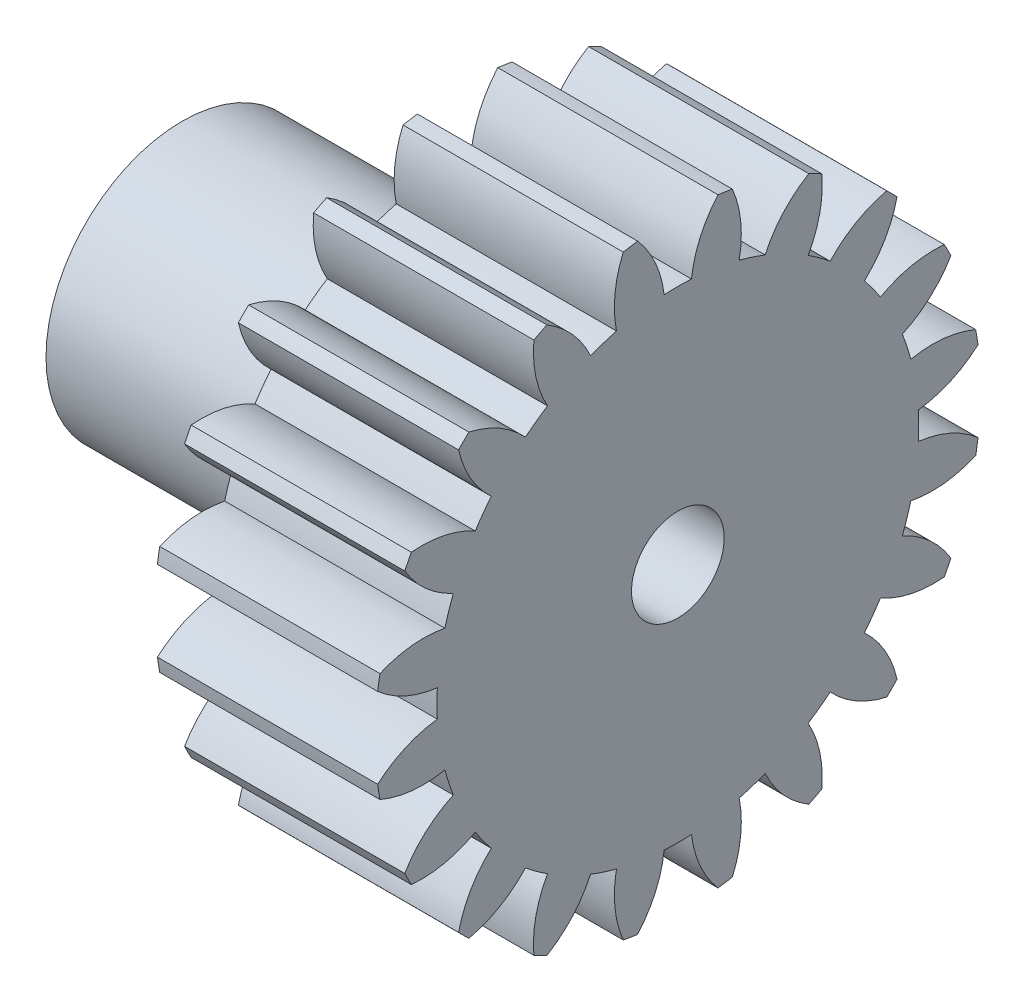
ISO-10303-21;
HEADER;
FILE_DESCRIPTION(('STEP AP214'),'2;1');
FILE_NAME('part.step','',(''),(''),'','','');
FILE_SCHEMA(('AUTOMOTIVE_DESIGN { 1 0 10303 214 1 1 1 1 }'));
ENDSEC;
DATA;
#1=APPLICATION_CONTEXT('core data for automotive mechanical design processes');
#2=APPLICATION_PROTOCOL_DEFINITION('international standard','automotive_design',2000,#1);
#3=PRODUCT_CONTEXT('',#1,'mechanical');
#4=PRODUCT('Part','Part','',(#3));
#5=PRODUCT_RELATED_PRODUCT_CATEGORY('part','',(#4));
#6=PRODUCT_DEFINITION_FORMATION('','',#4);
#7=PRODUCT_DEFINITION_CONTEXT('part definition',#1,'design');
#8=PRODUCT_DEFINITION('design','',#6,#7);
#9=PRODUCT_DEFINITION_SHAPE('','',#8);
#10=(LENGTH_UNIT() NAMED_UNIT(*) SI_UNIT(.MILLI.,.METRE.));
#11=(NAMED_UNIT(*) PLANE_ANGLE_UNIT() SI_UNIT($,.RADIAN.));
#12=(NAMED_UNIT(*) SI_UNIT($,.STERADIAN.) SOLID_ANGLE_UNIT());
#13=UNCERTAINTY_MEASURE_WITH_UNIT(LENGTH_MEASURE(1.E-05),#10,'distance_accuracy_value','');
#14=(GEOMETRIC_REPRESENTATION_CONTEXT(3) GLOBAL_UNCERTAINTY_ASSIGNED_CONTEXT((#13)) GLOBAL_UNIT_ASSIGNED_CONTEXT((#10,
#11,#12)) REPRESENTATION_CONTEXT('',''));
#15=CARTESIAN_POINT('',(0.,0.,0.));
#16=DIRECTION('',(0.,0.,1.));
#17=DIRECTION('',(1.,0.,0.));
#18=AXIS2_PLACEMENT_3D('',#15,#16,#17);
#19=CARTESIAN_POINT('',(16.,1.52824245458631,2.01));
#20=DIRECTION('',(0.,-1.,0.));
#21=DIRECTION('',(0.,0.,-1.));
#22=AXIS2_PLACEMENT_3D('',#19,#20,#21);
#23=PLANE('',#22);
#24=DIRECTION('',(-1.,0.,0.));
#25=VECTOR('',#24,1.);
#26=CARTESIAN_POINT('',(16.,1.52824245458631,-2.01));
#27=LINE('',#26,#25);
#28=CARTESIAN_POINT('',(10.,1.52824245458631,-2.01));
#29=VERTEX_POINT('',#28);
#30=CARTESIAN_POINT('',(4.,1.52824245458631,-2.01));
#31=VERTEX_POINT('',#30);
#32=EDGE_CURVE('E561',#29,#31,#27,.T.);
#33=ORIENTED_EDGE('',*,*,#32,.F.);
#34=DIRECTION('',(0.,0.,1.));
#35=VECTOR('',#34,1.);
#36=CARTESIAN_POINT('',(10.,1.52824245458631,2.01));
#37=LINE('',#36,#35);
#38=CARTESIAN_POINT('',(10.,1.52824245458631,2.01));
#39=VERTEX_POINT('',#38);
#40=EDGE_CURVE('E54',#29,#39,#37,.T.);
#41=ORIENTED_EDGE('',*,*,#40,.T.);
#42=DIRECTION('',(-1.,0.,0.));
#43=VECTOR('',#42,1.);
#44=CARTESIAN_POINT('',(16.,1.52824245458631,2.01));
#45=LINE('',#44,#43);
#46=CARTESIAN_POINT('',(4.,1.52824245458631,2.01));
#47=VERTEX_POINT('',#46);
#48=EDGE_CURVE('E567',#39,#47,#45,.T.);
#49=ORIENTED_EDGE('',*,*,#48,.T.);
#50=DIRECTION('',(0.,0.,-1.));
#51=VECTOR('',#50,1.);
#52=CARTESIAN_POINT('',(4.,1.52824245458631,0.));
#53=LINE('',#52,#51);
#54=EDGE_CURVE('E67',#47,#31,#53,.T.);
#55=ORIENTED_EDGE('',*,*,#54,.T.);
#56=EDGE_LOOP('',(#33,#41,#49,#55));
#57=FACE_BOUND('',#56,.T.);
#58=ADVANCED_FACE('F45',(#57),#23,.T.);
#59=CARTESIAN_POINT('',(16.,0.,0.));
#60=DIRECTION('',(-1.,0.,0.));
#61=DIRECTION('',(0.,0.,1.));
#62=AXIS2_PLACEMENT_3D('',#59,#60,#61);
#63=PLANE('',#62);
#64=CARTESIAN_POINT('',(16.,6.70132317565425,12.4004946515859));
#65=DIRECTION('',(-1.,0.,0.));
#66=DIRECTION('',(0.,1.,0.));
#67=AXIS2_PLACEMENT_3D('',#64,#65,#66);
#68=CIRCLE('',#67,6.);
#69=CARTESIAN_POINT('',(16.,0.742635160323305,13.1033724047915));
#70=VERTEX_POINT('',#69);
#71=CARTESIAN_POINT('',(16.,2.18825272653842,16.354251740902));
#72=VERTEX_POINT('',#71);
#73=EDGE_CURVE('E617',#70,#72,#68,.T.);
#74=ORIENTED_EDGE('',*,*,#73,.F.);
#75=CARTESIAN_POINT('',(16.,0.,0.));
#76=DIRECTION('',(-1.,0.,0.));
#77=DIRECTION('',(0.,1.,0.));
#78=AXIS2_PLACEMENT_3D('',#75,#76,#77);
#79=CIRCLE('',#78,13.1244);
#80=CARTESIAN_POINT('',(16.,-0.742635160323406,13.1033724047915));
#81=VERTEX_POINT('',#80);
#82=EDGE_CURVE('E624',#81,#70,#79,.T.);
#83=ORIENTED_EDGE('',*,*,#82,.F.);
#84=CARTESIAN_POINT('',(16.,-6.70132317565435,12.4004946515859));
#85=DIRECTION('',(-1.,0.,0.));
#86=DIRECTION('',(0.,1.,0.));
#87=AXIS2_PLACEMENT_3D('',#84,#85,#86);
#88=CIRCLE('',#87,6.);
#89=CARTESIAN_POINT('',(16.,-2.18825272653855,16.354251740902));
#90=VERTEX_POINT('',#89);
#91=EDGE_CURVE('E620',#90,#81,#88,.T.);
#92=ORIENTED_EDGE('',*,*,#91,.F.);
#93=CARTESIAN_POINT('',(16.,0.,0.));
#94=DIRECTION('',(-1.,0.,0.));
#95=DIRECTION('',(0.,0.,1.));
#96=AXIS2_PLACEMENT_3D('',#93,#94,#95);
#97=CIRCLE('',#96,16.5);
#98=CARTESIAN_POINT('',(16.,-2.97258970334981,16.2300249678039));
#99=VERTEX_POINT('',#98);
#100=EDGE_CURVE('E1393',#99,#90,#97,.T.);
#101=ORIENTED_EDGE('',*,*,#100,.F.);
#102=CARTESIAN_POINT('',(16.,2.54137348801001,13.8643939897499));
#103=DIRECTION('',(-1.,0.,0.));
#104=DIRECTION('',(0.,0.951056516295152,0.309016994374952));
#105=AXIS2_PLACEMENT_3D('',#102,#103,#104);
#106=CIRCLE('',#105,6.);
#107=CARTESIAN_POINT('',(16.,-3.34287674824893,12.6915345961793));
#108=VERTEX_POINT('',#107);
#109=EDGE_CURVE('E785',#108,#99,#106,.T.);
#110=ORIENTED_EDGE('',*,*,#109,.F.);
#111=CARTESIAN_POINT('',(16.,0.,0.));
#112=DIRECTION('',(-1.,0.,0.));
#113=DIRECTION('',(0.,0.951056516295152,0.309016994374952));
#114=AXIS2_PLACEMENT_3D('',#111,#112,#113);
#115=CIRCLE('',#114,13.1244);
#116=CARTESIAN_POINT('',(16.,-4.75545276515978,12.2325608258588));
#117=VERTEX_POINT('',#116);
#118=EDGE_CURVE('E792',#117,#108,#115,.T.);
#119=ORIENTED_EDGE('',*,*,#118,.F.);
#120=CARTESIAN_POINT('',(16.,-10.2053006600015,9.72274849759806));
#121=DIRECTION('',(-1.,0.,0.));
#122=DIRECTION('',(0.,0.951056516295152,0.309016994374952));
#123=AXIS2_PLACEMENT_3D('',#120,#121,#122);
#124=CIRCLE('',#123,6.);
#125=CARTESIAN_POINT('',(16.,-7.13489373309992,14.8776104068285));
#126=VERTEX_POINT('',#125);
#127=EDGE_CURVE('E788',#126,#117,#124,.T.);
#128=ORIENTED_EDGE('',*,*,#127,.F.);
#129=CARTESIAN_POINT('',(16.,-7.84245434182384,14.5170902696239));
#130=VERTEX_POINT('',#129);
#131=EDGE_CURVE('E1368',#130,#126,#97,.T.);
#132=ORIENTED_EDGE('',*,*,#131,.F.);
#133=CARTESIAN_POINT('',(16.,-1.86734354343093,13.971149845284));
#134=DIRECTION('',(-1.,0.,0.));
#135=DIRECTION('',(0.,0.809016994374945,0.587785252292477));
#136=AXIS2_PLACEMENT_3D('',#133,#134,#135);
#137=CIRCLE('',#136,6.);
#138=CARTESIAN_POINT('',(16.,-7.1011645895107,11.0373609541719));
#139=VERTEX_POINT('',#138);
#140=EDGE_CURVE('E761',#139,#130,#137,.T.);
#141=ORIENTED_EDGE('',*,*,#140,.F.);
#142=CARTESIAN_POINT('',(16.,0.,0.));
#143=DIRECTION('',(-1.,0.,0.));
#144=DIRECTION('',(0.,0.809016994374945,0.587785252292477));
#145=AXIS2_PLACEMENT_3D('',#142,#143,#144);
#146=CIRCLE('',#145,13.1244);
#147=CARTESIAN_POINT('',(16.,-8.30277352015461,10.1643409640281));
#148=VERTEX_POINT('',#147);
#149=EDGE_CURVE('E768',#148,#139,#146,.T.);
#150=ORIENTED_EDGE('',*,*,#149,.F.);
#151=CARTESIAN_POINT('',(16.,-12.7103122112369,6.09327197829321));
#152=DIRECTION('',(-1.,0.,0.));
#153=DIRECTION('',(0.,0.809016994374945,0.587785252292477));
#154=AXIS2_PLACEMENT_3D('',#151,#152,#153);
#155=CIRCLE('',#154,6.);
#156=CARTESIAN_POINT('',(16.,-11.3831216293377,11.9446449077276));
#157=VERTEX_POINT('',#156);
#158=EDGE_CURVE('E764',#157,#148,#155,.T.);
#159=ORIENTED_EDGE('',*,*,#158,.F.);
#160=CARTESIAN_POINT('',(16.,-11.9446449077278,11.3831216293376));
#161=VERTEX_POINT('',#160);
#162=EDGE_CURVE('E1501',#161,#157,#97,.T.);
#163=ORIENTED_EDGE('',*,*,#162,.F.);
#164=CARTESIAN_POINT('',(16.,-6.09327197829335,12.7103122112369));
#165=DIRECTION('',(-1.,0.,0.));
#166=DIRECTION('',(0.,0.587785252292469,0.809016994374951));
#167=AXIS2_PLACEMENT_3D('',#164,#165,#166);
#168=CIRCLE('',#167,6.);
#169=CARTESIAN_POINT('',(16.,-10.1643409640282,8.30277352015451));
#170=VERTEX_POINT('',#169);
#171=EDGE_CURVE('E737',#170,#161,#168,.T.);
#172=ORIENTED_EDGE('',*,*,#171,.F.);
#173=CARTESIAN_POINT('',(16.,0.,0.));
#174=DIRECTION('',(-1.,0.,0.));
#175=DIRECTION('',(0.,0.587785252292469,0.809016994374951));
#176=AXIS2_PLACEMENT_3D('',#173,#174,#175);
#177=CIRCLE('',#176,13.1244);
#178=CARTESIAN_POINT('',(16.,-11.037360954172,7.10116458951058));
#179=VERTEX_POINT('',#178);
#180=EDGE_CURVE('E744',#179,#170,#177,.T.);
#181=ORIENTED_EDGE('',*,*,#180,.F.);
#182=CARTESIAN_POINT('',(16.,-13.971149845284,1.86734354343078));
#183=DIRECTION('',(-1.,0.,0.));
#184=DIRECTION('',(0.,0.587785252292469,0.809016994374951));
#185=AXIS2_PLACEMENT_3D('',#182,#183,#184);
#186=CIRCLE('',#185,6.);
#187=CARTESIAN_POINT('',(16.,-14.517090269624,7.84245434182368));
#188=VERTEX_POINT('',#187);
#189=EDGE_CURVE('E740',#188,#179,#186,.T.);
#190=ORIENTED_EDGE('',*,*,#189,.F.);
#191=CARTESIAN_POINT('',(16.,-14.8776104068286,7.13489373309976));
#192=VERTEX_POINT('',#191);
#193=EDGE_CURVE('E1495',#192,#188,#97,.T.);
#194=ORIENTED_EDGE('',*,*,#193,.F.);
#195=CARTESIAN_POINT('',(16.,-9.72274849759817,10.2053006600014));
#196=DIRECTION('',(-1.,0.,0.));
#197=DIRECTION('',(0.,0.309016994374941,0.951056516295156));
#198=AXIS2_PLACEMENT_3D('',#195,#196,#197);
#199=CIRCLE('',#198,6.);
#200=CARTESIAN_POINT('',(16.,-12.2325608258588,4.75545276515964));
#201=VERTEX_POINT('',#200);
#202=EDGE_CURVE('E688',#201,#192,#199,.T.);
#203=ORIENTED_EDGE('',*,*,#202,.F.);
#204=CARTESIAN_POINT('',(16.,0.,0.));
#205=DIRECTION('',(-1.,0.,0.));
#206=DIRECTION('',(0.,0.309016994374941,0.951056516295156));
#207=AXIS2_PLACEMENT_3D('',#204,#205,#206);
#208=CIRCLE('',#207,13.1244);
#209=CARTESIAN_POINT('',(16.,-12.6915345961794,3.34287674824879));
#210=VERTEX_POINT('',#209);
#211=EDGE_CURVE('E694',#210,#201,#208,.T.);
#212=ORIENTED_EDGE('',*,*,#211,.F.);
#213=CARTESIAN_POINT('',(16.,-13.8643939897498,-2.54137348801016));
#214=DIRECTION('',(-1.,0.,0.));
#215=DIRECTION('',(0.,0.309016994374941,0.951056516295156));
#216=AXIS2_PLACEMENT_3D('',#213,#214,#215);
#217=CIRCLE('',#216,6.);
#218=CARTESIAN_POINT('',(16.,-16.230024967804,2.97258970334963));
#219=VERTEX_POINT('',#218);
#220=EDGE_CURVE('E691',#219,#210,#217,.T.);
#221=ORIENTED_EDGE('',*,*,#220,.F.);
#222=CARTESIAN_POINT('',(16.,-16.354251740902,2.18825272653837));
#223=VERTEX_POINT('',#222);
#224=EDGE_CURVE('E1488',#223,#219,#97,.T.);
#225=ORIENTED_EDGE('',*,*,#224,.F.);
#226=CARTESIAN_POINT('',(16.,-12.4004946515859,6.70132317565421));
#227=DIRECTION('',(-1.,0.,0.));
#228=DIRECTION('',(0.,0.,1.));
#229=AXIS2_PLACEMENT_3D('',#226,#227,#228);
#230=CIRCLE('',#229,6.);
#231=CARTESIAN_POINT('',(16.,-13.1033724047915,0.742635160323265));
#232=VERTEX_POINT('',#231);
#233=EDGE_CURVE('E713',#232,#223,#230,.T.);
#234=ORIENTED_EDGE('',*,*,#233,.F.);
#235=CARTESIAN_POINT('',(16.,0.,0.));
#236=DIRECTION('',(-1.,0.,0.));
#237=DIRECTION('',(0.,0.,1.));
#238=AXIS2_PLACEMENT_3D('',#235,#236,#237);
#239=CIRCLE('',#238,13.1244);
#240=CARTESIAN_POINT('',(16.,-13.1033724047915,-0.742635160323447));
#241=VERTEX_POINT('',#240);
#242=EDGE_CURVE('E720',#241,#232,#239,.T.);
#243=ORIENTED_EDGE('',*,*,#242,.F.);
#244=CARTESIAN_POINT('',(16.,-12.4004946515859,-6.70132317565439));
#245=DIRECTION('',(-1.,0.,0.));
#246=DIRECTION('',(0.,0.,1.));
#247=AXIS2_PLACEMENT_3D('',#244,#245,#246);
#248=CIRCLE('',#247,6.);
#249=CARTESIAN_POINT('',(16.,-16.354251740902,-2.1882527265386));
#250=VERTEX_POINT('',#249);
#251=EDGE_CURVE('E716',#250,#241,#248,.T.);
#252=ORIENTED_EDGE('',*,*,#251,.F.);
#253=CARTESIAN_POINT('',(16.,-16.2300249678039,-2.97258970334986));
#254=VERTEX_POINT('',#253);
#255=EDGE_CURVE('E1481',#254,#250,#97,.T.);
#256=ORIENTED_EDGE('',*,*,#255,.F.);
#257=CARTESIAN_POINT('',(16.,-13.8643939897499,2.54137348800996));
#258=DIRECTION('',(-1.,0.,0.));
#259=DIRECTION('',(0.,-0.309016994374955,0.951056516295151));
#260=AXIS2_PLACEMENT_3D('',#257,#258,#259);
#261=CIRCLE('',#260,6.);
#262=CARTESIAN_POINT('',(16.,-12.6915345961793,-3.34287674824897));
#263=VERTEX_POINT('',#262);
#264=EDGE_CURVE('E880',#263,#254,#261,.T.);
#265=ORIENTED_EDGE('',*,*,#264,.F.);
#266=CARTESIAN_POINT('',(16.,0.,0.));
#267=DIRECTION('',(-1.,0.,0.));
#268=DIRECTION('',(0.,-0.309016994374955,0.951056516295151));
#269=AXIS2_PLACEMENT_3D('',#266,#267,#268);
#270=CIRCLE('',#269,13.1244);
#271=CARTESIAN_POINT('',(16.,-12.2325608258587,-4.75545276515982));
#272=VERTEX_POINT('',#271);
#273=EDGE_CURVE('E887',#272,#263,#270,.T.);
#274=ORIENTED_EDGE('',*,*,#273,.F.);
#275=CARTESIAN_POINT('',(16.,-9.72274849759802,-10.2053006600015));
#276=DIRECTION('',(-1.,0.,0.));
#277=DIRECTION('',(0.,-0.309016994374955,0.951056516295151));
#278=AXIS2_PLACEMENT_3D('',#275,#276,#277);
#279=CIRCLE('',#278,6.);
#280=CARTESIAN_POINT('',(16.,-14.8776104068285,-7.13489373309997));
#281=VERTEX_POINT('',#280);
#282=EDGE_CURVE('E883',#281,#272,#279,.T.);
#283=ORIENTED_EDGE('',*,*,#282,.F.);
#284=CARTESIAN_POINT('',(16.,-14.5170902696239,-7.84245434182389));
#285=VERTEX_POINT('',#284);
#286=EDGE_CURVE('E1474',#285,#281,#97,.T.);
#287=ORIENTED_EDGE('',*,*,#286,.F.);
#288=CARTESIAN_POINT('',(16.,-13.971149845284,-1.86734354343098));
#289=DIRECTION('',(-1.,0.,0.));
#290=DIRECTION('',(0.,-0.58778525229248,0.809016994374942));
#291=AXIS2_PLACEMENT_3D('',#288,#289,#290);
#292=CIRCLE('',#291,6.);
#293=CARTESIAN_POINT('',(16.,-11.0373609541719,-7.10116458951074));
#294=VERTEX_POINT('',#293);
#295=EDGE_CURVE('E856',#294,#285,#292,.T.);
#296=ORIENTED_EDGE('',*,*,#295,.F.);
#297=CARTESIAN_POINT('',(16.,0.,0.));
#298=DIRECTION('',(-1.,0.,0.));
#299=DIRECTION('',(0.,-0.58778525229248,0.809016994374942));
#300=AXIS2_PLACEMENT_3D('',#297,#298,#299);
#301=CIRCLE('',#300,13.1244);
#302=CARTESIAN_POINT('',(16.,-10.1643409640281,-8.30277352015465));
#303=VERTEX_POINT('',#302);
#304=EDGE_CURVE('E863',#303,#294,#301,.T.);
#305=ORIENTED_EDGE('',*,*,#304,.F.);
#306=CARTESIAN_POINT('',(16.,-6.09327197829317,-12.710312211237));
#307=DIRECTION('',(-1.,0.,0.));
#308=DIRECTION('',(0.,-0.58778525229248,0.809016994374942));
#309=AXIS2_PLACEMENT_3D('',#306,#307,#308);
#310=CIRCLE('',#309,6.);
#311=CARTESIAN_POINT('',(16.,-11.9446449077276,-11.3831216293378));
#312=VERTEX_POINT('',#311);
#313=EDGE_CURVE('E859',#312,#303,#310,.T.);
#314=ORIENTED_EDGE('',*,*,#313,.F.);
#315=CARTESIAN_POINT('',(16.,-11.3831216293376,-11.9446449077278));
#316=VERTEX_POINT('',#315);
#317=EDGE_CURVE('E1468',#316,#312,#97,.T.);
#318=ORIENTED_EDGE('',*,*,#317,.F.);
#319=CARTESIAN_POINT('',(16.,-12.7103122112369,-6.0932719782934));
#320=DIRECTION('',(-1.,0.,0.));
#321=DIRECTION('',(0.,-0.809016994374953,0.587785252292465));
#322=AXIS2_PLACEMENT_3D('',#319,#320,#321);
#323=CIRCLE('',#322,6.);
#324=CARTESIAN_POINT('',(16.,-8.30277352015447,-10.1643409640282));
#325=VERTEX_POINT('',#324);
#326=EDGE_CURVE('E832',#325,#316,#323,.T.);
#327=ORIENTED_EDGE('',*,*,#326,.F.);
#328=CARTESIAN_POINT('',(16.,0.,0.));
#329=DIRECTION('',(-1.,0.,0.));
#330=DIRECTION('',(0.,-0.809016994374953,0.587785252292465));
#331=AXIS2_PLACEMENT_3D('',#328,#329,#330);
#332=CIRCLE('',#331,13.1244);
#333=CARTESIAN_POINT('',(16.,-7.10116458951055,-11.037360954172));
#334=VERTEX_POINT('',#333);
#335=EDGE_CURVE('E839',#334,#325,#332,.T.);
#336=ORIENTED_EDGE('',*,*,#335,.F.);
#337=CARTESIAN_POINT('',(16.,-1.86734354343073,-13.971149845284));
#338=DIRECTION('',(-1.,0.,0.));
#339=DIRECTION('',(0.,-0.809016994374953,0.587785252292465));
#340=AXIS2_PLACEMENT_3D('',#337,#338,#339);
#341=CIRCLE('',#340,6.);
#342=CARTESIAN_POINT('',(16.,-7.84245434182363,-14.517090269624));
#343=VERTEX_POINT('',#342);
#344=EDGE_CURVE('E835',#343,#334,#341,.T.);
#345=ORIENTED_EDGE('',*,*,#344,.F.);
#346=CARTESIAN_POINT('',(16.,-7.13489373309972,-14.8776104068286));
#347=VERTEX_POINT('',#346);
#348=EDGE_CURVE('E1461',#347,#343,#97,.T.);
#349=ORIENTED_EDGE('',*,*,#348,.F.);
#350=CARTESIAN_POINT('',(16.,-10.2053006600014,-9.72274849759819));
#351=DIRECTION('',(-1.,0.,0.));
#352=DIRECTION('',(0.,-0.951056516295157,0.309016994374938));
#353=AXIS2_PLACEMENT_3D('',#350,#351,#352);
#354=CIRCLE('',#353,6.);
#355=CARTESIAN_POINT('',(16.,-4.75545276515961,-12.2325608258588));
#356=VERTEX_POINT('',#355);
#357=EDGE_CURVE('E806',#356,#347,#354,.T.);
#358=ORIENTED_EDGE('',*,*,#357,.F.);
#359=CARTESIAN_POINT('',(16.,0.,0.));
#360=DIRECTION('',(-1.,0.,0.));
#361=DIRECTION('',(0.,-0.951056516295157,0.309016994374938));
#362=AXIS2_PLACEMENT_3D('',#359,#360,#361);
#363=CIRCLE('',#362,13.1244);
#364=CARTESIAN_POINT('',(16.,-3.34287674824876,-12.6915345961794));
#365=VERTEX_POINT('',#364);
#366=EDGE_CURVE('E813',#365,#356,#363,.T.);
#367=ORIENTED_EDGE('',*,*,#366,.F.);
#368=CARTESIAN_POINT('',(16.,2.5413734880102,-13.8643939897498));
#369=DIRECTION('',(-1.,0.,0.));
#370=DIRECTION('',(0.,-0.951056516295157,0.309016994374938));
#371=AXIS2_PLACEMENT_3D('',#368,#369,#370);
#372=CIRCLE('',#371,6.);
#373=CARTESIAN_POINT('',(16.,-2.97258970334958,-16.230024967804));
#374=VERTEX_POINT('',#373);
#375=EDGE_CURVE('E809',#374,#365,#372,.T.);
#376=ORIENTED_EDGE('',*,*,#375,.F.);
#377=CARTESIAN_POINT('',(16.,-2.18825272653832,-16.354251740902));
#378=VERTEX_POINT('',#377);
#379=EDGE_CURVE('E1453',#378,#374,#97,.T.);
#380=ORIENTED_EDGE('',*,*,#379,.F.);
#381=CARTESIAN_POINT('',(16.,-6.70132317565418,-12.400494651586));
#382=DIRECTION('',(-1.,0.,0.));
#383=DIRECTION('',(0.,-1.,0.));
#384=AXIS2_PLACEMENT_3D('',#381,#382,#383);
#385=CIRCLE('',#384,6.);
#386=CARTESIAN_POINT('',(16.,-0.742635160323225,-13.1033724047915));
#387=VERTEX_POINT('',#386);
#388=EDGE_CURVE('E973',#387,#378,#385,.T.);
#389=ORIENTED_EDGE('',*,*,#388,.F.);
#390=CARTESIAN_POINT('',(16.,0.,0.));
#391=DIRECTION('',(-1.,0.,0.));
#392=DIRECTION('',(0.,-1.,0.));
#393=AXIS2_PLACEMENT_3D('',#390,#391,#392);
#394=CIRCLE('',#393,13.1244);
#395=CARTESIAN_POINT('',(16.,0.742635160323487,-13.1033724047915));
#396=VERTEX_POINT('',#395);
#397=EDGE_CURVE('E980',#396,#387,#394,.T.);
#398=ORIENTED_EDGE('',*,*,#397,.F.);
#399=CARTESIAN_POINT('',(16.,6.70132317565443,-12.4004946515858));
#400=DIRECTION('',(-1.,0.,0.));
#401=DIRECTION('',(0.,-1.,0.));
#402=AXIS2_PLACEMENT_3D('',#399,#400,#401);
#403=CIRCLE('',#402,6.);
#404=CARTESIAN_POINT('',(16.,2.18825272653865,-16.354251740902));
#405=VERTEX_POINT('',#404);
#406=EDGE_CURVE('E976',#405,#396,#403,.T.);
#407=ORIENTED_EDGE('',*,*,#406,.F.);
#408=CARTESIAN_POINT('',(16.,2.97258970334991,-16.2300249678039));
#409=VERTEX_POINT('',#408);
#410=EDGE_CURVE('E1446',#409,#405,#97,.T.);
#411=ORIENTED_EDGE('',*,*,#410,.F.);
#412=CARTESIAN_POINT('',(16.,-2.54137348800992,-13.8643939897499));
#413=DIRECTION('',(-1.,0.,0.));
#414=DIRECTION('',(0.,-0.95105651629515,-0.309016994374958));
#415=AXIS2_PLACEMENT_3D('',#412,#413,#414);
#416=CIRCLE('',#415,6.);
#417=CARTESIAN_POINT('',(16.,3.34287674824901,-12.6915345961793));
#418=VERTEX_POINT('',#417);
#419=EDGE_CURVE('E997',#418,#409,#416,.T.);
#420=ORIENTED_EDGE('',*,*,#419,.F.);
#421=CARTESIAN_POINT('',(16.,0.,0.));
#422=DIRECTION('',(-1.,0.,0.));
#423=DIRECTION('',(0.,-0.95105651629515,-0.309016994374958));
#424=AXIS2_PLACEMENT_3D('',#421,#422,#423);
#425=CIRCLE('',#424,13.1244);
#426=CARTESIAN_POINT('',(16.,4.75545276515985,-12.2325608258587));
#427=VERTEX_POINT('',#426);
#428=EDGE_CURVE('E1004',#427,#418,#425,.T.);
#429=ORIENTED_EDGE('',*,*,#428,.F.);
#430=CARTESIAN_POINT('',(16.,10.2053006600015,-9.72274849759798));
#431=DIRECTION('',(-1.,0.,0.));
#432=DIRECTION('',(0.,-0.95105651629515,-0.309016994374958));
#433=AXIS2_PLACEMENT_3D('',#430,#431,#432);
#434=CIRCLE('',#433,6.);
#435=CARTESIAN_POINT('',(16.,7.13489373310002,-14.8776104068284));
#436=VERTEX_POINT('',#435);
#437=EDGE_CURVE('E1000',#436,#427,#434,.T.);
#438=ORIENTED_EDGE('',*,*,#437,.F.);
#439=CARTESIAN_POINT('',(16.,7.84245434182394,-14.5170902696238));
#440=VERTEX_POINT('',#439);
#441=EDGE_CURVE('E1439',#440,#436,#97,.T.);
#442=ORIENTED_EDGE('',*,*,#441,.F.);
#443=CARTESIAN_POINT('',(16.,1.86734354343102,-13.971149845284));
#444=DIRECTION('',(-1.,0.,0.));
#445=DIRECTION('',(0.,-0.80901699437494,-0.587785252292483));
#446=AXIS2_PLACEMENT_3D('',#443,#444,#445);
#447=CIRCLE('',#446,6.);
#448=CARTESIAN_POINT('',(16.,7.10116458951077,-11.0373609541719));
#449=VERTEX_POINT('',#448);
#450=EDGE_CURVE('E950',#449,#440,#447,.T.);
#451=ORIENTED_EDGE('',*,*,#450,.F.);
#452=CARTESIAN_POINT('',(16.,0.,0.));
#453=DIRECTION('',(-1.,0.,0.));
#454=DIRECTION('',(0.,-0.80901699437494,-0.587785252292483));
#455=AXIS2_PLACEMENT_3D('',#452,#453,#454);
#456=CIRCLE('',#455,13.1244);
#457=CARTESIAN_POINT('',(16.,8.30277352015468,-10.164340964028));
#458=VERTEX_POINT('',#457);
#459=EDGE_CURVE('E957',#458,#449,#456,.T.);
#460=ORIENTED_EDGE('',*,*,#459,.F.);
#461=CARTESIAN_POINT('',(16.,12.710312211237,-6.09327197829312));
#462=DIRECTION('',(-1.,0.,0.));
#463=DIRECTION('',(0.,-0.80901699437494,-0.587785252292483));
#464=AXIS2_PLACEMENT_3D('',#461,#462,#463);
#465=CIRCLE('',#464,6.);
#466=CARTESIAN_POINT('',(16.,11.3831216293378,-11.9446449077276));
#467=VERTEX_POINT('',#466);
#468=EDGE_CURVE('E953',#467,#458,#465,.T.);
#469=ORIENTED_EDGE('',*,*,#468,.F.);
#470=CARTESIAN_POINT('',(16.,11.9446449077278,-11.3831216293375));
#471=VERTEX_POINT('',#470);
#472=EDGE_CURVE('E1432',#471,#467,#97,.T.);
#473=ORIENTED_EDGE('',*,*,#472,.F.);
#474=CARTESIAN_POINT('',(16.,6.09327197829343,-12.7103122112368));
#475=DIRECTION('',(-1.,0.,0.));
#476=DIRECTION('',(0.,-0.587785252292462,-0.809016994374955));
#477=AXIS2_PLACEMENT_3D('',#474,#475,#476);
#478=CIRCLE('',#477,6.);
#479=CARTESIAN_POINT('',(16.,10.1643409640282,-8.30277352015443));
#480=VERTEX_POINT('',#479);
#481=EDGE_CURVE('E926',#480,#471,#478,.T.);
#482=ORIENTED_EDGE('',*,*,#481,.F.);
#483=CARTESIAN_POINT('',(16.,0.,0.));
#484=DIRECTION('',(-1.,0.,0.));
#485=DIRECTION('',(0.,-0.587785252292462,-0.809016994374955));
#486=AXIS2_PLACEMENT_3D('',#483,#484,#485);
#487=CIRCLE('',#486,13.1244);
#488=CARTESIAN_POINT('',(16.,11.0373609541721,-7.1011645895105));
#489=VERTEX_POINT('',#488);
#490=EDGE_CURVE('E933',#489,#480,#487,.T.);
#491=ORIENTED_EDGE('',*,*,#490,.F.);
#492=CARTESIAN_POINT('',(16.,13.971149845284,-1.86734354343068));
#493=DIRECTION('',(-1.,0.,0.));
#494=DIRECTION('',(0.,-0.587785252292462,-0.809016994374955));
#495=AXIS2_PLACEMENT_3D('',#492,#493,#494);
#496=CIRCLE('',#495,6.);
#497=CARTESIAN_POINT('',(16.,14.517090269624,-7.84245434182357));
#498=VERTEX_POINT('',#497);
#499=EDGE_CURVE('E929',#498,#489,#496,.T.);
#500=ORIENTED_EDGE('',*,*,#499,.F.);
#501=CARTESIAN_POINT('',(16.,14.8776104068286,-7.13489373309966));
#502=VERTEX_POINT('',#501);
#503=EDGE_CURVE('E1201',#502,#498,#97,.T.);
#504=ORIENTED_EDGE('',*,*,#503,.F.);
#505=CARTESIAN_POINT('',(16.,9.72274849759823,-10.2053006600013));
#506=DIRECTION('',(-1.,0.,0.));
#507=DIRECTION('',(0.,-0.309016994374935,-0.951056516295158));
#508=AXIS2_PLACEMENT_3D('',#505,#506,#507);
#509=CIRCLE('',#508,6.);
#510=CARTESIAN_POINT('',(16.,12.2325608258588,-4.75545276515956));
#511=VERTEX_POINT('',#510);
#512=EDGE_CURVE('E902',#511,#502,#509,.T.);
#513=ORIENTED_EDGE('',*,*,#512,.F.);
#514=CARTESIAN_POINT('',(16.,0.,0.));
#515=DIRECTION('',(-1.,0.,0.));
#516=DIRECTION('',(0.,-0.309016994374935,-0.951056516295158));
#517=AXIS2_PLACEMENT_3D('',#514,#515,#516);
#518=CIRCLE('',#517,13.1244);
#519=CARTESIAN_POINT('',(16.,12.6915345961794,-3.34287674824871));
#520=VERTEX_POINT('',#519);
#521=EDGE_CURVE('E909',#520,#511,#518,.T.);
#522=ORIENTED_EDGE('',*,*,#521,.F.);
#523=CARTESIAN_POINT('',(16.,13.8643939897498,2.54137348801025));
#524=DIRECTION('',(-1.,0.,0.));
#525=DIRECTION('',(0.,-0.309016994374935,-0.951056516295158));
#526=AXIS2_PLACEMENT_3D('',#523,#524,#525);
#527=CIRCLE('',#526,6.);
#528=CARTESIAN_POINT('',(16.,16.230024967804,-2.97258970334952));
#529=VERTEX_POINT('',#528);
#530=EDGE_CURVE('E905',#529,#520,#527,.T.);
#531=ORIENTED_EDGE('',*,*,#530,.F.);
#532=CARTESIAN_POINT('',(16.,16.354251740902,-2.18825272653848));
#533=VERTEX_POINT('',#532);
#534=EDGE_CURVE('E1196',#533,#529,#97,.T.);
#535=ORIENTED_EDGE('',*,*,#534,.F.);
#536=CARTESIAN_POINT('',(16.,12.4004946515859,-6.7013231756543));
#537=DIRECTION('',(-1.,0.,0.));
#538=DIRECTION('',(0.,0.,-1.));
#539=AXIS2_PLACEMENT_3D('',#536,#537,#538);
#540=CIRCLE('',#539,6.);
#541=CARTESIAN_POINT('',(16.,13.1033724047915,-0.742635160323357));
#542=VERTEX_POINT('',#541);
#543=EDGE_CURVE('E1158',#542,#533,#540,.T.);
#544=ORIENTED_EDGE('',*,*,#543,.F.);
#545=CARTESIAN_POINT('',(16.,0.,0.));
#546=DIRECTION('',(-1.,0.,0.));
#547=DIRECTION('',(0.,0.,-1.));
#548=AXIS2_PLACEMENT_3D('',#545,#546,#547);
#549=CIRCLE('',#548,13.1244);
#550=CARTESIAN_POINT('',(16.,13.1033724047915,0.742635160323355));
#551=VERTEX_POINT('',#550);
#552=EDGE_CURVE('E1165',#551,#542,#549,.T.);
#553=ORIENTED_EDGE('',*,*,#552,.F.);
#554=CARTESIAN_POINT('',(16.,12.4004946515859,6.7013231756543));
#555=DIRECTION('',(-1.,0.,0.));
#556=DIRECTION('',(0.,0.,-1.));
#557=AXIS2_PLACEMENT_3D('',#554,#555,#556);
#558=CIRCLE('',#557,6.);
#559=CARTESIAN_POINT('',(16.,16.354251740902,2.18825272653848));
#560=VERTEX_POINT('',#559);
#561=EDGE_CURVE('E1161',#560,#551,#558,.T.);
#562=ORIENTED_EDGE('',*,*,#561,.F.);
#563=CARTESIAN_POINT('',(16.,16.2300249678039,2.97258970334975));
#564=VERTEX_POINT('',#563);
#565=EDGE_CURVE('E1193',#564,#560,#97,.T.);
#566=ORIENTED_EDGE('',*,*,#565,.F.);
#567=CARTESIAN_POINT('',(16.,13.8643939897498,-2.54137348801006));
#568=DIRECTION('',(-1.,0.,0.));
#569=DIRECTION('',(0.,0.309016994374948,-0.951056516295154));
#570=AXIS2_PLACEMENT_3D('',#567,#568,#569);
#571=CIRCLE('',#570,6.);
#572=CARTESIAN_POINT('',(16.,12.6915345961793,3.34287674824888));
#573=VERTEX_POINT('',#572);
#574=EDGE_CURVE('E1127',#573,#564,#571,.T.);
#575=ORIENTED_EDGE('',*,*,#574,.F.);
#576=CARTESIAN_POINT('',(16.,0.,0.));
#577=DIRECTION('',(-1.,0.,0.));
#578=DIRECTION('',(0.,0.309016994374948,-0.951056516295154));
#579=AXIS2_PLACEMENT_3D('',#576,#577,#578);
#580=CIRCLE('',#579,13.1244);
#581=CARTESIAN_POINT('',(16.,12.2325608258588,4.75545276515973));
#582=VERTEX_POINT('',#581);
#583=EDGE_CURVE('E1134',#582,#573,#580,.T.);
#584=ORIENTED_EDGE('',*,*,#583,.F.);
#585=CARTESIAN_POINT('',(16.,9.72274849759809,10.2053006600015));
#586=DIRECTION('',(-1.,0.,0.));
#587=DIRECTION('',(0.,0.309016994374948,-0.951056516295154));
#588=AXIS2_PLACEMENT_3D('',#585,#586,#587);
#589=CIRCLE('',#588,6.);
#590=CARTESIAN_POINT('',(16.,14.8776104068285,7.13489373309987));
#591=VERTEX_POINT('',#590);
#592=EDGE_CURVE('E1130',#591,#582,#589,.T.);
#593=ORIENTED_EDGE('',*,*,#592,.F.);
#594=CARTESIAN_POINT('',(16.,14.5170902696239,7.84245434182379));
#595=VERTEX_POINT('',#594);
#596=EDGE_CURVE('E1202',#595,#591,#97,.T.);
#597=ORIENTED_EDGE('',*,*,#596,.F.);
#598=CARTESIAN_POINT('',(16.,13.971149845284,1.86734354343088));
#599=DIRECTION('',(-1.,0.,0.));
#600=DIRECTION('',(0.,0.587785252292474,-0.809016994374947));
#601=AXIS2_PLACEMENT_3D('',#598,#599,#600);
#602=CIRCLE('',#601,6.);
#603=CARTESIAN_POINT('',(16.,11.037360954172,7.10116458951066));
#604=VERTEX_POINT('',#603);
#605=EDGE_CURVE('E664',#604,#595,#602,.T.);
#606=ORIENTED_EDGE('',*,*,#605,.F.);
#607=CARTESIAN_POINT('',(16.,0.,0.));
#608=DIRECTION('',(-1.,0.,0.));
#609=DIRECTION('',(0.,0.587785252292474,-0.809016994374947));
#610=AXIS2_PLACEMENT_3D('',#607,#608,#609);
#611=CIRCLE('',#610,13.1244);
#612=CARTESIAN_POINT('',(16.,10.1643409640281,8.30277352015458));
#613=VERTEX_POINT('',#612);
#614=EDGE_CURVE('E671',#613,#604,#611,.T.);
#615=ORIENTED_EDGE('',*,*,#614,.F.);
#616=CARTESIAN_POINT('',(16.,6.09327197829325,12.7103122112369));
#617=DIRECTION('',(-1.,0.,0.));
#618=DIRECTION('',(0.,0.587785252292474,-0.809016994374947));
#619=AXIS2_PLACEMENT_3D('',#616,#617,#618);
#620=CIRCLE('',#619,6.);
#621=CARTESIAN_POINT('',(16.,11.9446449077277,11.3831216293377));
#622=VERTEX_POINT('',#621);
#623=EDGE_CURVE('E667',#622,#613,#620,.T.);
#624=ORIENTED_EDGE('',*,*,#623,.F.);
#625=CARTESIAN_POINT('',(16.,11.3831216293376,11.9446449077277));
#626=VERTEX_POINT('',#625);
#627=EDGE_CURVE('E1410',#626,#622,#97,.T.);
#628=ORIENTED_EDGE('',*,*,#627,.F.);
#629=CARTESIAN_POINT('',(16.,12.7103122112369,6.0932719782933));
#630=DIRECTION('',(-1.,0.,0.));
#631=DIRECTION('',(0.,0.809016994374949,-0.587785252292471));
#632=AXIS2_PLACEMENT_3D('',#629,#630,#631);
#633=CIRCLE('',#632,6.);
#634=CARTESIAN_POINT('',(16.,8.30277352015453,10.1643409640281));
#635=VERTEX_POINT('',#634);
#636=EDGE_CURVE('E640',#635,#626,#633,.T.);
#637=ORIENTED_EDGE('',*,*,#636,.F.);
#638=CARTESIAN_POINT('',(16.,0.,0.));
#639=DIRECTION('',(-1.,0.,0.));
#640=DIRECTION('',(0.,0.809016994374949,-0.587785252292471));
#641=AXIS2_PLACEMENT_3D('',#638,#639,#640);
#642=CIRCLE('',#641,13.1244);
#643=CARTESIAN_POINT('',(16.,7.10116458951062,11.037360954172));
#644=VERTEX_POINT('',#643);
#645=EDGE_CURVE('E647',#644,#635,#642,.T.);
#646=ORIENTED_EDGE('',*,*,#645,.F.);
#647=CARTESIAN_POINT('',(16.,1.86734354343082,13.971149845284));
#648=DIRECTION('',(-1.,0.,0.));
#649=DIRECTION('',(0.,0.809016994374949,-0.587785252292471));
#650=AXIS2_PLACEMENT_3D('',#647,#648,#649);
#651=CIRCLE('',#650,6.);
#652=CARTESIAN_POINT('',(16.,7.84245434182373,14.5170902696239));
#653=VERTEX_POINT('',#652);
#654=EDGE_CURVE('E643',#653,#644,#651,.T.);
#655=ORIENTED_EDGE('',*,*,#654,.F.);
#656=CARTESIAN_POINT('',(16.,7.13489373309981,14.8776104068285));
#657=VERTEX_POINT('',#656);
#658=EDGE_CURVE('E1406',#657,#653,#97,.T.);
#659=ORIENTED_EDGE('',*,*,#658,.F.);
#660=CARTESIAN_POINT('',(16.,10.2053006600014,9.72274849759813));
#661=DIRECTION('',(-1.,0.,0.));
#662=DIRECTION('',(0.,0.951056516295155,-0.309016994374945));
#663=AXIS2_PLACEMENT_3D('',#660,#661,#662);
#664=CIRCLE('',#663,6.);
#665=CARTESIAN_POINT('',(16.,4.75545276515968,12.2325608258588));
#666=VERTEX_POINT('',#665);
#667=EDGE_CURVE('E591',#666,#657,#664,.T.);
#668=ORIENTED_EDGE('',*,*,#667,.F.);
#669=CARTESIAN_POINT('',(16.,0.,0.));
#670=DIRECTION('',(-1.,0.,0.));
#671=DIRECTION('',(0.,0.951056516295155,-0.309016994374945));
#672=AXIS2_PLACEMENT_3D('',#669,#670,#671);
#673=CIRCLE('',#672,13.1244);
#674=CARTESIAN_POINT('',(16.,3.34287674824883,12.6915345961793));
#675=VERTEX_POINT('',#674);
#676=EDGE_CURVE('E598',#675,#666,#673,.T.);
#677=ORIENTED_EDGE('',*,*,#676,.F.);
#678=CARTESIAN_POINT('',(16.,-2.54137348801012,13.8643939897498));
#679=DIRECTION('',(-1.,0.,0.));
#680=DIRECTION('',(0.,0.951056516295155,-0.309016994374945));
#681=AXIS2_PLACEMENT_3D('',#678,#679,#680);
#682=CIRCLE('',#681,6.);
#683=CARTESIAN_POINT('',(16.,2.97258970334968,16.2300249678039));
#684=VERTEX_POINT('',#683);
#685=EDGE_CURVE('E594',#684,#675,#682,.T.);
#686=ORIENTED_EDGE('',*,*,#685,.F.);
#687=EDGE_CURVE('E1274',#72,#684,#97,.T.);
#688=ORIENTED_EDGE('',*,*,#687,.F.);
#689=EDGE_LOOP('',(#74,#83,#92,#101,#110,#119,#128,#132,#141,#150,#159,#163,#172,#181,#190,#194,
#203,#212,#221,#225,#234,#243,#252,#256,#265,#274,#283,#287,#296,#305,#314,#318,#327,#336,#345,
#349,#358,#367,#376,#380,#389,#398,#407,#411,#420,#429,#438,#442,#451,#460,#469,#473,#482,#491,
#500,#504,#513,#522,#531,#535,#544,#553,#562,#566,#575,#584,#593,#597,#606,#615,#624,#628,#637,
#646,#655,#659,#668,#677,#686,#688));
#690=FACE_BOUND('',#689,.T.);
#691=CARTESIAN_POINT('',(16.,0.,0.));
#692=DIRECTION('',(1.,0.,0.));
#693=DIRECTION('',(0.,0.,-1.));
#694=AXIS2_PLACEMENT_3D('',#691,#692,#693);
#695=CIRCLE('',#694,2.525);
#696=CARTESIAN_POINT('',(16.,0.,-2.525));
#697=VERTEX_POINT('',#696);
#698=EDGE_CURVE('E582',#697,#697,#695,.T.);
#699=ORIENTED_EDGE('',*,*,#698,.F.);
#700=EDGE_LOOP('',(#699));
#701=FACE_BOUND('',#700,.T.);
#702=ADVANCED_FACE('F47',(#690,#701),#63,.F.);
#703=CARTESIAN_POINT('',(4.,0.,0.));
#704=DIRECTION('',(1.,0.,0.));
#705=DIRECTION('',(0.,0.,-1.));
#706=AXIS2_PLACEMENT_3D('',#703,#704,#705);
#707=PLANE('',#706);
#708=CARTESIAN_POINT('',(4.,0.,0.));
#709=DIRECTION('',(1.,0.,0.));
#710=DIRECTION('',(0.,0.,-1.));
#711=AXIS2_PLACEMENT_3D('',#708,#709,#710);
#712=CIRCLE('',#711,7.425);
#713=CARTESIAN_POINT('',(4.,0.,-7.425));
#714=VERTEX_POINT('',#713);
#715=EDGE_CURVE('E11',#714,#714,#712,.F.);
#716=ORIENTED_EDGE('',*,*,#715,.F.);
#717=EDGE_LOOP('',(#716));
#718=FACE_BOUND('',#717,.T.);
#719=CARTESIAN_POINT('',(4.,6.70132317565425,12.4004946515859));
#720=DIRECTION('',(-1.,0.,0.));
#721=DIRECTION('',(0.,1.,0.));
#722=AXIS2_PLACEMENT_3D('',#719,#720,#721);
#723=CIRCLE('',#722,6.);
#724=CARTESIAN_POINT('',(4.,0.742635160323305,13.1033724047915));
#725=VERTEX_POINT('',#724);
#726=CARTESIAN_POINT('',(4.,2.18825272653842,16.354251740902));
#727=VERTEX_POINT('',#726);
#728=EDGE_CURVE('E627',#725,#727,#723,.T.);
#729=ORIENTED_EDGE('',*,*,#728,.T.);
#730=CARTESIAN_POINT('',(4.,0.,0.));
#731=DIRECTION('',(-1.,0.,0.));
#732=DIRECTION('',(0.,0.,1.));
#733=AXIS2_PLACEMENT_3D('',#730,#731,#732);
#734=CIRCLE('',#733,16.5);
#735=CARTESIAN_POINT('',(4.,2.97258970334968,16.2300249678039));
#736=VERTEX_POINT('',#735);
#737=EDGE_CURVE('E1272',#727,#736,#734,.T.);
#738=ORIENTED_EDGE('',*,*,#737,.T.);
#739=CARTESIAN_POINT('',(4.,-2.54137348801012,13.8643939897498));
#740=DIRECTION('',(1.,0.,0.));
#741=DIRECTION('',(0.,0.,-1.));
#742=AXIS2_PLACEMENT_3D('',#739,#740,#741);
#743=CIRCLE('',#742,6.);
#744=CARTESIAN_POINT('',(4.,3.34287674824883,12.6915345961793));
#745=VERTEX_POINT('',#744);
#746=EDGE_CURVE('E575',#745,#736,#743,.T.);
#747=ORIENTED_EDGE('',*,*,#746,.F.);
#748=CARTESIAN_POINT('',(4.,0.,0.));
#749=DIRECTION('',(-1.,0.,0.));
#750=DIRECTION('',(0.,0.951056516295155,-0.309016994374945));
#751=AXIS2_PLACEMENT_3D('',#748,#749,#750);
#752=CIRCLE('',#751,13.1244);
#753=CARTESIAN_POINT('',(4.,4.75545276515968,12.2325608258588));
#754=VERTEX_POINT('',#753);
#755=EDGE_CURVE('E595',#745,#754,#752,.T.);
#756=ORIENTED_EDGE('',*,*,#755,.T.);
#757=CARTESIAN_POINT('',(4.,10.2053006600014,9.72274849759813));
#758=DIRECTION('',(-1.,0.,0.));
#759=DIRECTION('',(0.,0.951056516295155,-0.309016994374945));
#760=AXIS2_PLACEMENT_3D('',#757,#758,#759);
#761=CIRCLE('',#760,6.);
#762=CARTESIAN_POINT('',(4.,7.13489373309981,14.8776104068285));
#763=VERTEX_POINT('',#762);
#764=EDGE_CURVE('E602',#754,#763,#761,.T.);
#765=ORIENTED_EDGE('',*,*,#764,.T.);
#766=CARTESIAN_POINT('',(4.,7.84245434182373,14.5170902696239));
#767=VERTEX_POINT('',#766);
#768=EDGE_CURVE('E1278',#763,#767,#734,.T.);
#769=ORIENTED_EDGE('',*,*,#768,.T.);
#770=CARTESIAN_POINT('',(4.,1.86734354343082,13.971149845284));
#771=DIRECTION('',(1.,0.,0.));
#772=DIRECTION('',(0.,0.,-1.));
#773=AXIS2_PLACEMENT_3D('',#770,#771,#772);
#774=CIRCLE('',#773,6.);
#775=CARTESIAN_POINT('',(4.,7.10116458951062,11.037360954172));
#776=VERTEX_POINT('',#775);
#777=EDGE_CURVE('E1252',#776,#767,#774,.T.);
#778=ORIENTED_EDGE('',*,*,#777,.F.);
#779=CARTESIAN_POINT('',(4.,0.,0.));
#780=DIRECTION('',(-1.,0.,0.));
#781=DIRECTION('',(0.,0.809016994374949,-0.587785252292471));
#782=AXIS2_PLACEMENT_3D('',#779,#780,#781);
#783=CIRCLE('',#782,13.1244);
#784=CARTESIAN_POINT('',(4.,8.30277352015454,10.1643409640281));
#785=VERTEX_POINT('',#784);
#786=EDGE_CURVE('E644',#776,#785,#783,.T.);
#787=ORIENTED_EDGE('',*,*,#786,.T.);
#788=CARTESIAN_POINT('',(4.,12.7103122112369,6.0932719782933));
#789=DIRECTION('',(-1.,0.,0.));
#790=DIRECTION('',(0.,0.809016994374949,-0.587785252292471));
#791=AXIS2_PLACEMENT_3D('',#788,#789,#790);
#792=CIRCLE('',#791,6.);
#793=CARTESIAN_POINT('',(4.,11.3831216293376,11.9446449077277));
#794=VERTEX_POINT('',#793);
#795=EDGE_CURVE('E616',#785,#794,#792,.T.);
#796=ORIENTED_EDGE('',*,*,#795,.T.);
#797=CARTESIAN_POINT('',(4.,11.9446449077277,11.3831216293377));
#798=VERTEX_POINT('',#797);
#799=EDGE_CURVE('E1285',#794,#798,#734,.T.);
#800=ORIENTED_EDGE('',*,*,#799,.T.);
#801=CARTESIAN_POINT('',(4.,6.09327197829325,12.7103122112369));
#802=DIRECTION('',(1.,0.,0.));
#803=DIRECTION('',(0.,0.,-1.));
#804=AXIS2_PLACEMENT_3D('',#801,#802,#803);
#805=CIRCLE('',#804,6.);
#806=CARTESIAN_POINT('',(4.,10.1643409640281,8.30277352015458));
#807=VERTEX_POINT('',#806);
#808=EDGE_CURVE('E1255',#807,#798,#805,.T.);
#809=ORIENTED_EDGE('',*,*,#808,.F.);
#810=CARTESIAN_POINT('',(4.,0.,0.));
#811=DIRECTION('',(-1.,0.,0.));
#812=DIRECTION('',(0.,0.587785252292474,-0.809016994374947));
#813=AXIS2_PLACEMENT_3D('',#810,#811,#812);
#814=CIRCLE('',#813,13.1244);
#815=CARTESIAN_POINT('',(4.,11.037360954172,7.10116458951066));
#816=VERTEX_POINT('',#815);
#817=EDGE_CURVE('E668',#807,#816,#814,.T.);
#818=ORIENTED_EDGE('',*,*,#817,.T.);
#819=CARTESIAN_POINT('',(4.,13.971149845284,1.86734354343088));
#820=DIRECTION('',(-1.,0.,0.));
#821=DIRECTION('',(0.,0.587785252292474,-0.809016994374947));
#822=AXIS2_PLACEMENT_3D('',#819,#820,#821);
#823=CIRCLE('',#822,6.);
#824=CARTESIAN_POINT('',(4.,14.5170902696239,7.84245434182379));
#825=VERTEX_POINT('',#824);
#826=EDGE_CURVE('E663',#816,#825,#823,.T.);
#827=ORIENTED_EDGE('',*,*,#826,.T.);
#828=CARTESIAN_POINT('',(4.,14.8776104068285,7.13489373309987));
#829=VERTEX_POINT('',#828);
#830=EDGE_CURVE('E1195',#825,#829,#734,.T.);
#831=ORIENTED_EDGE('',*,*,#830,.T.);
#832=CARTESIAN_POINT('',(4.,9.72274849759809,10.2053006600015));
#833=DIRECTION('',(1.,0.,0.));
#834=DIRECTION('',(0.,0.,-1.));
#835=AXIS2_PLACEMENT_3D('',#832,#833,#834);
#836=CIRCLE('',#835,6.);
#837=CARTESIAN_POINT('',(4.,12.2325608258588,4.75545276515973));
#838=VERTEX_POINT('',#837);
#839=EDGE_CURVE('E1206',#838,#829,#836,.T.);
#840=ORIENTED_EDGE('',*,*,#839,.F.);
#841=CARTESIAN_POINT('',(4.,0.,0.));
#842=DIRECTION('',(-1.,0.,0.));
#843=DIRECTION('',(0.,0.309016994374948,-0.951056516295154));
#844=AXIS2_PLACEMENT_3D('',#841,#842,#843);
#845=CIRCLE('',#844,13.1244);
#846=CARTESIAN_POINT('',(4.,12.6915345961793,3.34287674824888));
#847=VERTEX_POINT('',#846);
#848=EDGE_CURVE('E1131',#838,#847,#845,.T.);
#849=ORIENTED_EDGE('',*,*,#848,.T.);
#850=CARTESIAN_POINT('',(4.,13.8643939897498,-2.54137348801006));
#851=DIRECTION('',(-1.,0.,0.));
#852=DIRECTION('',(0.,0.309016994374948,-0.951056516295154));
#853=AXIS2_PLACEMENT_3D('',#850,#851,#852);
#854=CIRCLE('',#853,6.);
#855=CARTESIAN_POINT('',(4.,16.2300249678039,2.97258970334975));
#856=VERTEX_POINT('',#855);
#857=EDGE_CURVE('E1126',#847,#856,#854,.T.);
#858=ORIENTED_EDGE('',*,*,#857,.T.);
#859=CARTESIAN_POINT('',(4.,16.354251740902,2.18825272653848));
#860=VERTEX_POINT('',#859);
#861=EDGE_CURVE('E1188',#856,#860,#734,.T.);
#862=ORIENTED_EDGE('',*,*,#861,.T.);
#863=CARTESIAN_POINT('',(4.,12.4004946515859,6.7013231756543));
#864=DIRECTION('',(1.,0.,0.));
#865=DIRECTION('',(0.,0.,-1.));
#866=AXIS2_PLACEMENT_3D('',#863,#864,#865);
#867=CIRCLE('',#866,6.);
#868=CARTESIAN_POINT('',(4.,13.1033724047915,0.742635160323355));
#869=VERTEX_POINT('',#868);
#870=EDGE_CURVE('E1200',#869,#860,#867,.T.);
#871=ORIENTED_EDGE('',*,*,#870,.F.);
#872=CARTESIAN_POINT('',(4.,0.,0.));
#873=DIRECTION('',(-1.,0.,0.));
#874=DIRECTION('',(0.,0.,-1.));
#875=AXIS2_PLACEMENT_3D('',#872,#873,#874);
#876=CIRCLE('',#875,13.1244);
#877=CARTESIAN_POINT('',(4.,13.1033724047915,-0.742635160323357));
#878=VERTEX_POINT('',#877);
#879=EDGE_CURVE('E1162',#869,#878,#876,.T.);
#880=ORIENTED_EDGE('',*,*,#879,.T.);
#881=CARTESIAN_POINT('',(4.,12.4004946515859,-6.7013231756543));
#882=DIRECTION('',(-1.,0.,0.));
#883=DIRECTION('',(0.,0.,-1.));
#884=AXIS2_PLACEMENT_3D('',#881,#882,#883);
#885=CIRCLE('',#884,6.);
#886=CARTESIAN_POINT('',(4.,16.354251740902,-2.18825272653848));
#887=VERTEX_POINT('',#886);
#888=EDGE_CURVE('E1157',#878,#887,#885,.T.);
#889=ORIENTED_EDGE('',*,*,#888,.T.);
#890=CARTESIAN_POINT('',(4.,16.230024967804,-2.97258970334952));
#891=VERTEX_POINT('',#890);
#892=EDGE_CURVE('E1189',#887,#891,#734,.T.);
#893=ORIENTED_EDGE('',*,*,#892,.T.);
#894=CARTESIAN_POINT('',(4.,13.8643939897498,2.54137348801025));
#895=DIRECTION('',(1.,0.,0.));
#896=DIRECTION('',(0.,0.,-1.));
#897=AXIS2_PLACEMENT_3D('',#894,#895,#896);
#898=CIRCLE('',#897,6.);
#899=CARTESIAN_POINT('',(4.,12.6915345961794,-3.34287674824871));
#900=VERTEX_POINT('',#899);
#901=EDGE_CURVE('E1219',#900,#891,#898,.T.);
#902=ORIENTED_EDGE('',*,*,#901,.F.);
#903=CARTESIAN_POINT('',(4.,0.,0.));
#904=DIRECTION('',(-1.,0.,0.));
#905=DIRECTION('',(0.,-0.309016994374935,-0.951056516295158));
#906=AXIS2_PLACEMENT_3D('',#903,#904,#905);
#907=CIRCLE('',#906,13.1244);
#908=CARTESIAN_POINT('',(4.,12.2325608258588,-4.75545276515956));
#909=VERTEX_POINT('',#908);
#910=EDGE_CURVE('E906',#900,#909,#907,.T.);
#911=ORIENTED_EDGE('',*,*,#910,.T.);
#912=CARTESIAN_POINT('',(4.,9.72274849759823,-10.2053006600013));
#913=DIRECTION('',(-1.,0.,0.));
#914=DIRECTION('',(0.,-0.309016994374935,-0.951056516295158));
#915=AXIS2_PLACEMENT_3D('',#912,#913,#914);
#916=CIRCLE('',#915,6.);
#917=CARTESIAN_POINT('',(4.,14.8776104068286,-7.13489373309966));
#918=VERTEX_POINT('',#917);
#919=EDGE_CURVE('E566',#909,#918,#916,.T.);
#920=ORIENTED_EDGE('',*,*,#919,.T.);
#921=CARTESIAN_POINT('',(4.,14.517090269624,-7.84245434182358));
#922=VERTEX_POINT('',#921);
#923=EDGE_CURVE('E1194',#918,#922,#734,.T.);
#924=ORIENTED_EDGE('',*,*,#923,.T.);
#925=CARTESIAN_POINT('',(4.,13.971149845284,-1.86734354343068));
#926=DIRECTION('',(1.,0.,0.));
#927=DIRECTION('',(0.,0.,-1.));
#928=AXIS2_PLACEMENT_3D('',#925,#926,#927);
#929=CIRCLE('',#928,6.);
#930=CARTESIAN_POINT('',(4.,11.0373609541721,-7.1011645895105));
#931=VERTEX_POINT('',#930);
#932=EDGE_CURVE('E1216',#931,#922,#929,.T.);
#933=ORIENTED_EDGE('',*,*,#932,.F.);
#934=CARTESIAN_POINT('',(4.,0.,0.));
#935=DIRECTION('',(-1.,0.,0.));
#936=DIRECTION('',(0.,-0.587785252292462,-0.809016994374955));
#937=AXIS2_PLACEMENT_3D('',#934,#935,#936);
#938=CIRCLE('',#937,13.1244);
#939=CARTESIAN_POINT('',(4.,10.1643409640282,-8.30277352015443));
#940=VERTEX_POINT('',#939);
#941=EDGE_CURVE('E930',#931,#940,#938,.T.);
#942=ORIENTED_EDGE('',*,*,#941,.T.);
#943=CARTESIAN_POINT('',(4.,6.09327197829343,-12.7103122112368));
#944=DIRECTION('',(-1.,0.,0.));
#945=DIRECTION('',(0.,-0.587785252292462,-0.809016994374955));
#946=AXIS2_PLACEMENT_3D('',#943,#944,#945);
#947=CIRCLE('',#946,6.);
#948=CARTESIAN_POINT('',(4.,11.9446449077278,-11.3831216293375));
#949=VERTEX_POINT('',#948);
#950=EDGE_CURVE('E925',#940,#949,#947,.T.);
#951=ORIENTED_EDGE('',*,*,#950,.T.);
#952=CARTESIAN_POINT('',(4.,11.3831216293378,-11.9446449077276));
#953=VERTEX_POINT('',#952);
#954=EDGE_CURVE('E1302',#949,#953,#734,.T.);
#955=ORIENTED_EDGE('',*,*,#954,.T.);
#956=CARTESIAN_POINT('',(4.,12.710312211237,-6.09327197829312));
#957=DIRECTION('',(1.,0.,0.));
#958=DIRECTION('',(0.,0.,-1.));
#959=AXIS2_PLACEMENT_3D('',#956,#957,#958);
#960=CIRCLE('',#959,6.);
#961=CARTESIAN_POINT('',(4.,8.30277352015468,-10.164340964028));
#962=VERTEX_POINT('',#961);
#963=EDGE_CURVE('E1222',#962,#953,#960,.T.);
#964=ORIENTED_EDGE('',*,*,#963,.F.);
#965=CARTESIAN_POINT('',(4.,0.,0.));
#966=DIRECTION('',(-1.,0.,0.));
#967=DIRECTION('',(0.,-0.80901699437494,-0.587785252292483));
#968=AXIS2_PLACEMENT_3D('',#965,#966,#967);
#969=CIRCLE('',#968,13.1244);
#970=CARTESIAN_POINT('',(4.,7.10116458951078,-11.0373609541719));
#971=VERTEX_POINT('',#970);
#972=EDGE_CURVE('E954',#962,#971,#969,.T.);
#973=ORIENTED_EDGE('',*,*,#972,.T.);
#974=CARTESIAN_POINT('',(4.,1.86734354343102,-13.971149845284));
#975=DIRECTION('',(-1.,0.,0.));
#976=DIRECTION('',(0.,-0.80901699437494,-0.587785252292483));
#977=AXIS2_PLACEMENT_3D('',#974,#975,#976);
#978=CIRCLE('',#977,6.);
#979=CARTESIAN_POINT('',(4.,7.84245434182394,-14.5170902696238));
#980=VERTEX_POINT('',#979);
#981=EDGE_CURVE('E949',#971,#980,#978,.T.);
#982=ORIENTED_EDGE('',*,*,#981,.T.);
#983=CARTESIAN_POINT('',(4.,7.13489373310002,-14.8776104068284));
#984=VERTEX_POINT('',#983);
#985=EDGE_CURVE('E1306',#980,#984,#734,.T.);
#986=ORIENTED_EDGE('',*,*,#985,.T.);
#987=CARTESIAN_POINT('',(4.,10.2053006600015,-9.72274849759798));
#988=DIRECTION('',(1.,0.,0.));
#989=DIRECTION('',(0.,0.,-1.));
#990=AXIS2_PLACEMENT_3D('',#987,#988,#989);
#991=CIRCLE('',#990,6.);
#992=CARTESIAN_POINT('',(4.,4.75545276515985,-12.2325608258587));
#993=VERTEX_POINT('',#992);
#994=EDGE_CURVE('E1213',#993,#984,#991,.T.);
#995=ORIENTED_EDGE('',*,*,#994,.F.);
#996=CARTESIAN_POINT('',(4.,0.,0.));
#997=DIRECTION('',(-1.,0.,0.));
#998=DIRECTION('',(0.,-0.95105651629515,-0.309016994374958));
#999=AXIS2_PLACEMENT_3D('',#996,#997,#998);
#1000=CIRCLE('',#999,13.1244);
#1001=CARTESIAN_POINT('',(4.,3.34287674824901,-12.6915345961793));
#1002=VERTEX_POINT('',#1001);
#1003=EDGE_CURVE('E1001',#993,#1002,#1000,.T.);
#1004=ORIENTED_EDGE('',*,*,#1003,.T.);
#1005=CARTESIAN_POINT('',(4.,-2.54137348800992,-13.8643939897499));
#1006=DIRECTION('',(-1.,0.,0.));
#1007=DIRECTION('',(0.,-0.95105651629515,-0.309016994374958));
#1008=AXIS2_PLACEMENT_3D('',#1005,#1006,#1007);
#1009=CIRCLE('',#1008,6.);
#1010=CARTESIAN_POINT('',(4.,2.97258970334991,-16.2300249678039));
#1011=VERTEX_POINT('',#1010);
#1012=EDGE_CURVE('E972',#1002,#1011,#1009,.T.);
#1013=ORIENTED_EDGE('',*,*,#1012,.T.);
#1014=CARTESIAN_POINT('',(4.,2.18825272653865,-16.354251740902));
#1015=VERTEX_POINT('',#1014);
#1016=EDGE_CURVE('E1311',#1011,#1015,#734,.T.);
#1017=ORIENTED_EDGE('',*,*,#1016,.T.);
#1018=CARTESIAN_POINT('',(4.,6.70132317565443,-12.4004946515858));
#1019=DIRECTION('',(1.,0.,0.));
#1020=DIRECTION('',(0.,0.,-1.));
#1021=AXIS2_PLACEMENT_3D('',#1018,#1019,#1020);
#1022=CIRCLE('',#1021,6.);
#1023=CARTESIAN_POINT('',(4.,0.742635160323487,-13.1033724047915));
#1024=VERTEX_POINT('',#1023);
#1025=EDGE_CURVE('E1210',#1024,#1015,#1022,.T.);
#1026=ORIENTED_EDGE('',*,*,#1025,.F.);
#1027=CARTESIAN_POINT('',(4.,0.,0.));
#1028=DIRECTION('',(-1.,0.,0.));
#1029=DIRECTION('',(0.,-1.,0.));
#1030=AXIS2_PLACEMENT_3D('',#1027,#1028,#1029);
#1031=CIRCLE('',#1030,13.1244);
#1032=CARTESIAN_POINT('',(4.,-0.742635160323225,-13.1033724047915));
#1033=VERTEX_POINT('',#1032);
#1034=EDGE_CURVE('E977',#1024,#1033,#1031,.T.);
#1035=ORIENTED_EDGE('',*,*,#1034,.T.);
#1036=CARTESIAN_POINT('',(4.,-6.70132317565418,-12.400494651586));
#1037=DIRECTION('',(-1.,0.,0.));
#1038=DIRECTION('',(0.,-1.,0.));
#1039=AXIS2_PLACEMENT_3D('',#1036,#1037,#1038);
#1040=CIRCLE('',#1039,6.);
#1041=CARTESIAN_POINT('',(4.,-2.18825272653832,-16.354251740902));
#1042=VERTEX_POINT('',#1041);
#1043=EDGE_CURVE('E984',#1033,#1042,#1040,.T.);
#1044=ORIENTED_EDGE('',*,*,#1043,.T.);
#1045=CARTESIAN_POINT('',(4.,-2.97258970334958,-16.230024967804));
#1046=VERTEX_POINT('',#1045);
#1047=EDGE_CURVE('E1316',#1042,#1046,#734,.T.);
#1048=ORIENTED_EDGE('',*,*,#1047,.T.);
#1049=CARTESIAN_POINT('',(4.,2.5413734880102,-13.8643939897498));
#1050=DIRECTION('',(1.,0.,0.));
#1051=DIRECTION('',(0.,0.,-1.));
#1052=AXIS2_PLACEMENT_3D('',#1049,#1050,#1051);
#1053=CIRCLE('',#1052,6.);
#1054=CARTESIAN_POINT('',(4.,-3.34287674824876,-12.6915345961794));
#1055=VERTEX_POINT('',#1054);
#1056=EDGE_CURVE('E1231',#1055,#1046,#1053,.T.);
#1057=ORIENTED_EDGE('',*,*,#1056,.F.);
#1058=CARTESIAN_POINT('',(4.,0.,0.));
#1059=DIRECTION('',(-1.,0.,0.));
#1060=DIRECTION('',(0.,-0.951056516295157,0.309016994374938));
#1061=AXIS2_PLACEMENT_3D('',#1058,#1059,#1060);
#1062=CIRCLE('',#1061,13.1244);
#1063=CARTESIAN_POINT('',(4.,-4.75545276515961,-12.2325608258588));
#1064=VERTEX_POINT('',#1063);
#1065=EDGE_CURVE('E810',#1055,#1064,#1062,.T.);
#1066=ORIENTED_EDGE('',*,*,#1065,.T.);
#1067=CARTESIAN_POINT('',(4.,-10.2053006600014,-9.72274849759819));
#1068=DIRECTION('',(-1.,0.,0.));
#1069=DIRECTION('',(0.,-0.951056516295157,0.309016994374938));
#1070=AXIS2_PLACEMENT_3D('',#1067,#1068,#1069);
#1071=CIRCLE('',#1070,6.);
#1072=CARTESIAN_POINT('',(4.,-7.13489373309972,-14.8776104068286));
#1073=VERTEX_POINT('',#1072);
#1074=EDGE_CURVE('E817',#1064,#1073,#1071,.T.);
#1075=ORIENTED_EDGE('',*,*,#1074,.T.);
#1076=CARTESIAN_POINT('',(4.,-7.84245434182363,-14.517090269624));
#1077=VERTEX_POINT('',#1076);
#1078=EDGE_CURVE('E1322',#1073,#1077,#734,.T.);
#1079=ORIENTED_EDGE('',*,*,#1078,.T.);
#1080=CARTESIAN_POINT('',(4.,-1.86734354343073,-13.971149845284));
#1081=DIRECTION('',(1.,0.,0.));
#1082=DIRECTION('',(0.,0.,-1.));
#1083=AXIS2_PLACEMENT_3D('',#1080,#1081,#1082);
#1084=CIRCLE('',#1083,6.);
#1085=CARTESIAN_POINT('',(4.,-7.10116458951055,-11.037360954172));
#1086=VERTEX_POINT('',#1085);
#1087=EDGE_CURVE('E1234',#1086,#1077,#1084,.T.);
#1088=ORIENTED_EDGE('',*,*,#1087,.F.);
#1089=CARTESIAN_POINT('',(4.,0.,0.));
#1090=DIRECTION('',(-1.,0.,0.));
#1091=DIRECTION('',(0.,-0.809016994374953,0.587785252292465));
#1092=AXIS2_PLACEMENT_3D('',#1089,#1090,#1091);
#1093=CIRCLE('',#1092,13.1244);
#1094=CARTESIAN_POINT('',(4.,-8.30277352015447,-10.1643409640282));
#1095=VERTEX_POINT('',#1094);
#1096=EDGE_CURVE('E836',#1086,#1095,#1093,.T.);
#1097=ORIENTED_EDGE('',*,*,#1096,.T.);
#1098=CARTESIAN_POINT('',(4.,-12.7103122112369,-6.0932719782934));
#1099=DIRECTION('',(-1.,0.,0.));
#1100=DIRECTION('',(0.,-0.809016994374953,0.587785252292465));
#1101=AXIS2_PLACEMENT_3D('',#1098,#1099,#1100);
#1102=CIRCLE('',#1101,6.);
#1103=CARTESIAN_POINT('',(4.,-11.3831216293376,-11.9446449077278));
#1104=VERTEX_POINT('',#1103);
#1105=EDGE_CURVE('E831',#1095,#1104,#1102,.T.);
#1106=ORIENTED_EDGE('',*,*,#1105,.T.);
#1107=CARTESIAN_POINT('',(4.,-11.9446449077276,-11.3831216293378));
#1108=VERTEX_POINT('',#1107);
#1109=EDGE_CURVE('E1327',#1104,#1108,#734,.T.);
#1110=ORIENTED_EDGE('',*,*,#1109,.T.);
#1111=CARTESIAN_POINT('',(4.,-6.09327197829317,-12.710312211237));
#1112=DIRECTION('',(1.,0.,0.));
#1113=DIRECTION('',(0.,0.,-1.));
#1114=AXIS2_PLACEMENT_3D('',#1111,#1112,#1113);
#1115=CIRCLE('',#1114,6.);
#1116=CARTESIAN_POINT('',(4.,-10.1643409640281,-8.30277352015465));
#1117=VERTEX_POINT('',#1116);
#1118=EDGE_CURVE('E1225',#1117,#1108,#1115,.T.);
#1119=ORIENTED_EDGE('',*,*,#1118,.F.);
#1120=CARTESIAN_POINT('',(4.,0.,0.));
#1121=DIRECTION('',(-1.,0.,0.));
#1122=DIRECTION('',(0.,-0.58778525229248,0.809016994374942));
#1123=AXIS2_PLACEMENT_3D('',#1120,#1121,#1122);
#1124=CIRCLE('',#1123,13.1244);
#1125=CARTESIAN_POINT('',(4.,-11.0373609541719,-7.10116458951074));
#1126=VERTEX_POINT('',#1125);
#1127=EDGE_CURVE('E860',#1117,#1126,#1124,.T.);
#1128=ORIENTED_EDGE('',*,*,#1127,.T.);
#1129=CARTESIAN_POINT('',(4.,-13.971149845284,-1.86734354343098));
#1130=DIRECTION('',(-1.,0.,0.));
#1131=DIRECTION('',(0.,-0.58778525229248,0.809016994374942));
#1132=AXIS2_PLACEMENT_3D('',#1129,#1130,#1131);
#1133=CIRCLE('',#1132,6.);
#1134=CARTESIAN_POINT('',(4.,-14.5170902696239,-7.84245434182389));
#1135=VERTEX_POINT('',#1134);
#1136=EDGE_CURVE('E855',#1126,#1135,#1133,.T.);
#1137=ORIENTED_EDGE('',*,*,#1136,.T.);
#1138=CARTESIAN_POINT('',(4.,-14.8776104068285,-7.13489373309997));
#1139=VERTEX_POINT('',#1138);
#1140=EDGE_CURVE('E1332',#1135,#1139,#734,.T.);
#1141=ORIENTED_EDGE('',*,*,#1140,.T.);
#1142=CARTESIAN_POINT('',(4.,-9.72274849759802,-10.2053006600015));
#1143=DIRECTION('',(1.,0.,0.));
#1144=DIRECTION('',(0.,0.,-1.));
#1145=AXIS2_PLACEMENT_3D('',#1142,#1143,#1144);
#1146=CIRCLE('',#1145,6.);
#1147=CARTESIAN_POINT('',(4.,-12.2325608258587,-4.75545276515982));
#1148=VERTEX_POINT('',#1147);
#1149=EDGE_CURVE('E1228',#1148,#1139,#1146,.T.);
#1150=ORIENTED_EDGE('',*,*,#1149,.F.);
#1151=CARTESIAN_POINT('',(4.,0.,0.));
#1152=DIRECTION('',(-1.,0.,0.));
#1153=DIRECTION('',(0.,-0.309016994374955,0.951056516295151));
#1154=AXIS2_PLACEMENT_3D('',#1151,#1152,#1153);
#1155=CIRCLE('',#1154,13.1244);
#1156=CARTESIAN_POINT('',(4.,-12.6915345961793,-3.34287674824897));
#1157=VERTEX_POINT('',#1156);
#1158=EDGE_CURVE('E884',#1148,#1157,#1155,.T.);
#1159=ORIENTED_EDGE('',*,*,#1158,.T.);
#1160=CARTESIAN_POINT('',(4.,-13.8643939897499,2.54137348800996));
#1161=DIRECTION('',(-1.,0.,0.));
#1162=DIRECTION('',(0.,-0.309016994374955,0.951056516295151));
#1163=AXIS2_PLACEMENT_3D('',#1160,#1161,#1162);
#1164=CIRCLE('',#1163,6.);
#1165=CARTESIAN_POINT('',(4.,-16.2300249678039,-2.97258970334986));
#1166=VERTEX_POINT('',#1165);
#1167=EDGE_CURVE('E879',#1157,#1166,#1164,.T.);
#1168=ORIENTED_EDGE('',*,*,#1167,.T.);
#1169=CARTESIAN_POINT('',(4.,-16.354251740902,-2.1882527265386));
#1170=VERTEX_POINT('',#1169);
#1171=EDGE_CURVE('E1337',#1166,#1170,#734,.T.);
#1172=ORIENTED_EDGE('',*,*,#1171,.T.);
#1173=CARTESIAN_POINT('',(4.,-12.4004946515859,-6.70132317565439));
#1174=DIRECTION('',(1.,0.,0.));
#1175=DIRECTION('',(0.,0.,-1.));
#1176=AXIS2_PLACEMENT_3D('',#1173,#1174,#1175);
#1177=CIRCLE('',#1176,6.);
#1178=CARTESIAN_POINT('',(4.,-13.1033724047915,-0.742635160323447));
#1179=VERTEX_POINT('',#1178);
#1180=EDGE_CURVE('E1243',#1179,#1170,#1177,.T.);
#1181=ORIENTED_EDGE('',*,*,#1180,.F.);
#1182=CARTESIAN_POINT('',(4.,0.,0.));
#1183=DIRECTION('',(-1.,0.,0.));
#1184=DIRECTION('',(0.,0.,1.));
#1185=AXIS2_PLACEMENT_3D('',#1182,#1183,#1184);
#1186=CIRCLE('',#1185,13.1244);
#1187=CARTESIAN_POINT('',(4.,-13.1033724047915,0.742635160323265));
#1188=VERTEX_POINT('',#1187);
#1189=EDGE_CURVE('E717',#1179,#1188,#1186,.T.);
#1190=ORIENTED_EDGE('',*,*,#1189,.T.);
#1191=CARTESIAN_POINT('',(4.,-12.4004946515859,6.70132317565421));
#1192=DIRECTION('',(-1.,0.,0.));
#1193=DIRECTION('',(0.,0.,1.));
#1194=AXIS2_PLACEMENT_3D('',#1191,#1192,#1193);
#1195=CIRCLE('',#1194,6.);
#1196=CARTESIAN_POINT('',(4.,-16.354251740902,2.18825272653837));
#1197=VERTEX_POINT('',#1196);
#1198=EDGE_CURVE('E724',#1188,#1197,#1195,.T.);
#1199=ORIENTED_EDGE('',*,*,#1198,.T.);
#1200=CARTESIAN_POINT('',(4.,-16.230024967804,2.97258970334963));
#1201=VERTEX_POINT('',#1200);
#1202=EDGE_CURVE('E1342',#1197,#1201,#734,.T.);
#1203=ORIENTED_EDGE('',*,*,#1202,.T.);
#1204=CARTESIAN_POINT('',(4.,-13.8643939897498,-2.54137348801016));
#1205=DIRECTION('',(1.,0.,0.));
#1206=DIRECTION('',(0.,0.,-1.));
#1207=AXIS2_PLACEMENT_3D('',#1204,#1205,#1206);
#1208=CIRCLE('',#1207,6.);
#1209=CARTESIAN_POINT('',(4.,-12.6915345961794,3.34287674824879));
#1210=VERTEX_POINT('',#1209);
#1211=EDGE_CURVE('E1246',#1210,#1201,#1208,.T.);
#1212=ORIENTED_EDGE('',*,*,#1211,.F.);
#1213=CARTESIAN_POINT('',(4.,0.,0.));
#1214=DIRECTION('',(-1.,0.,0.));
#1215=DIRECTION('',(0.,0.309016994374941,0.951056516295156));
#1216=AXIS2_PLACEMENT_3D('',#1213,#1214,#1215);
#1217=CIRCLE('',#1216,13.1244);
#1218=CARTESIAN_POINT('',(4.,-12.2325608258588,4.75545276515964));
#1219=VERTEX_POINT('',#1218);
#1220=EDGE_CURVE('E692',#1210,#1219,#1217,.T.);
#1221=ORIENTED_EDGE('',*,*,#1220,.T.);
#1222=CARTESIAN_POINT('',(4.,-9.72274849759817,10.2053006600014));
#1223=DIRECTION('',(-1.,0.,0.));
#1224=DIRECTION('',(0.,0.309016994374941,0.951056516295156));
#1225=AXIS2_PLACEMENT_3D('',#1222,#1223,#1224);
#1226=CIRCLE('',#1225,6.);
#1227=CARTESIAN_POINT('',(4.,-14.8776104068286,7.13489373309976));
#1228=VERTEX_POINT('',#1227);
#1229=EDGE_CURVE('E698',#1219,#1228,#1226,.T.);
#1230=ORIENTED_EDGE('',*,*,#1229,.T.);
#1231=CARTESIAN_POINT('',(4.,-14.517090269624,7.84245434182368));
#1232=VERTEX_POINT('',#1231);
#1233=EDGE_CURVE('E1347',#1228,#1232,#734,.T.);
#1234=ORIENTED_EDGE('',*,*,#1233,.T.);
#1235=CARTESIAN_POINT('',(4.,-13.971149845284,1.86734354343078));
#1236=DIRECTION('',(1.,0.,0.));
#1237=DIRECTION('',(0.,0.,-1.));
#1238=AXIS2_PLACEMENT_3D('',#1235,#1236,#1237);
#1239=CIRCLE('',#1238,6.);
#1240=CARTESIAN_POINT('',(4.,-11.037360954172,7.10116458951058));
#1241=VERTEX_POINT('',#1240);
#1242=EDGE_CURVE('E1249',#1241,#1232,#1239,.T.);
#1243=ORIENTED_EDGE('',*,*,#1242,.F.);
#1244=CARTESIAN_POINT('',(4.,0.,0.));
#1245=DIRECTION('',(-1.,0.,0.));
#1246=DIRECTION('',(0.,0.587785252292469,0.809016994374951));
#1247=AXIS2_PLACEMENT_3D('',#1244,#1245,#1246);
#1248=CIRCLE('',#1247,13.1244);
#1249=CARTESIAN_POINT('',(4.,-10.1643409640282,8.30277352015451));
#1250=VERTEX_POINT('',#1249);
#1251=EDGE_CURVE('E741',#1241,#1250,#1248,.T.);
#1252=ORIENTED_EDGE('',*,*,#1251,.T.);
#1253=CARTESIAN_POINT('',(4.,-6.09327197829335,12.7103122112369));
#1254=DIRECTION('',(-1.,0.,0.));
#1255=DIRECTION('',(0.,0.587785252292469,0.809016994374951));
#1256=AXIS2_PLACEMENT_3D('',#1253,#1254,#1255);
#1257=CIRCLE('',#1256,6.);
#1258=CARTESIAN_POINT('',(4.,-11.9446449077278,11.3831216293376));
#1259=VERTEX_POINT('',#1258);
#1260=EDGE_CURVE('E712',#1250,#1259,#1257,.T.);
#1261=ORIENTED_EDGE('',*,*,#1260,.T.);
#1262=CARTESIAN_POINT('',(4.,-11.3831216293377,11.9446449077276));
#1263=VERTEX_POINT('',#1262);
#1264=EDGE_CURVE('E1351',#1259,#1263,#734,.T.);
#1265=ORIENTED_EDGE('',*,*,#1264,.T.);
#1266=CARTESIAN_POINT('',(4.,-12.7103122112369,6.09327197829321));
#1267=DIRECTION('',(1.,0.,0.));
#1268=DIRECTION('',(0.,0.,-1.));
#1269=AXIS2_PLACEMENT_3D('',#1266,#1267,#1268);
#1270=CIRCLE('',#1269,6.);
#1271=CARTESIAN_POINT('',(4.,-8.30277352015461,10.1643409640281));
#1272=VERTEX_POINT('',#1271);
#1273=EDGE_CURVE('E1237',#1272,#1263,#1270,.T.);
#1274=ORIENTED_EDGE('',*,*,#1273,.F.);
#1275=CARTESIAN_POINT('',(4.,0.,0.));
#1276=DIRECTION('',(-1.,0.,0.));
#1277=DIRECTION('',(0.,0.809016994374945,0.587785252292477));
#1278=AXIS2_PLACEMENT_3D('',#1275,#1276,#1277);
#1279=CIRCLE('',#1278,13.1244);
#1280=CARTESIAN_POINT('',(4.,-7.1011645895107,11.0373609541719));
#1281=VERTEX_POINT('',#1280);
#1282=EDGE_CURVE('E765',#1272,#1281,#1279,.T.);
#1283=ORIENTED_EDGE('',*,*,#1282,.T.);
#1284=CARTESIAN_POINT('',(4.,-1.86734354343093,13.971149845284));
#1285=DIRECTION('',(-1.,0.,0.));
#1286=DIRECTION('',(0.,0.809016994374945,0.587785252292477));
#1287=AXIS2_PLACEMENT_3D('',#1284,#1285,#1286);
#1288=CIRCLE('',#1287,6.);
#1289=CARTESIAN_POINT('',(4.,-7.84245434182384,14.5170902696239));
#1290=VERTEX_POINT('',#1289);
#1291=EDGE_CURVE('E760',#1281,#1290,#1288,.T.);
#1292=ORIENTED_EDGE('',*,*,#1291,.T.);
#1293=CARTESIAN_POINT('',(4.,-7.13489373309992,14.8776104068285));
#1294=VERTEX_POINT('',#1293);
#1295=EDGE_CURVE('E1282',#1290,#1294,#734,.T.);
#1296=ORIENTED_EDGE('',*,*,#1295,.T.);
#1297=CARTESIAN_POINT('',(4.,-10.2053006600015,9.72274849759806));
#1298=DIRECTION('',(1.,0.,0.));
#1299=DIRECTION('',(0.,0.,-1.));
#1300=AXIS2_PLACEMENT_3D('',#1297,#1298,#1299);
#1301=CIRCLE('',#1300,6.);
#1302=CARTESIAN_POINT('',(4.,-4.75545276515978,12.2325608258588));
#1303=VERTEX_POINT('',#1302);
#1304=EDGE_CURVE('E1240',#1303,#1294,#1301,.T.);
#1305=ORIENTED_EDGE('',*,*,#1304,.F.);
#1306=CARTESIAN_POINT('',(4.,0.,0.));
#1307=DIRECTION('',(-1.,0.,0.));
#1308=DIRECTION('',(0.,0.951056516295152,0.309016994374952));
#1309=AXIS2_PLACEMENT_3D('',#1306,#1307,#1308);
#1310=CIRCLE('',#1309,13.1244);
#1311=CARTESIAN_POINT('',(4.,-3.34287674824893,12.6915345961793));
#1312=VERTEX_POINT('',#1311);
#1313=EDGE_CURVE('E789',#1303,#1312,#1310,.T.);
#1314=ORIENTED_EDGE('',*,*,#1313,.T.);
#1315=CARTESIAN_POINT('',(4.,2.54137348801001,13.8643939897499));
#1316=DIRECTION('',(-1.,0.,0.));
#1317=DIRECTION('',(0.,0.951056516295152,0.309016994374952));
#1318=AXIS2_PLACEMENT_3D('',#1315,#1316,#1317);
#1319=CIRCLE('',#1318,6.);
#1320=CARTESIAN_POINT('',(4.,-2.97258970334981,16.2300249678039));
#1321=VERTEX_POINT('',#1320);
#1322=EDGE_CURVE('E784',#1312,#1321,#1319,.T.);
#1323=ORIENTED_EDGE('',*,*,#1322,.T.);
#1324=CARTESIAN_POINT('',(4.,-2.18825272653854,16.354251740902));
#1325=VERTEX_POINT('',#1324);
#1326=EDGE_CURVE('E1277',#1321,#1325,#734,.T.);
#1327=ORIENTED_EDGE('',*,*,#1326,.T.);
#1328=CARTESIAN_POINT('',(4.,-6.70132317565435,12.4004946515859));
#1329=DIRECTION('',(1.,0.,0.));
#1330=DIRECTION('',(0.,0.,-1.));
#1331=AXIS2_PLACEMENT_3D('',#1328,#1329,#1330);
#1332=CIRCLE('',#1331,6.);
#1333=CARTESIAN_POINT('',(4.,-0.742635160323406,13.1033724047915));
#1334=VERTEX_POINT('',#1333);
#1335=EDGE_CURVE('E570',#1334,#1325,#1332,.T.);
#1336=ORIENTED_EDGE('',*,*,#1335,.F.);
#1337=CARTESIAN_POINT('',(4.,0.,0.));
#1338=DIRECTION('',(-1.,0.,0.));
#1339=DIRECTION('',(0.,1.,0.));
#1340=AXIS2_PLACEMENT_3D('',#1337,#1338,#1339);
#1341=CIRCLE('',#1340,13.1244);
#1342=EDGE_CURVE('E621',#1334,#725,#1341,.T.);
#1343=ORIENTED_EDGE('',*,*,#1342,.T.);
#1344=EDGE_LOOP('',(#729,#738,#747,#756,#765,#769,#778,#787,#796,#800,#809,#818,#827,#831,#840,
#849,#858,#862,#871,#880,#889,#893,#902,#911,#920,#924,#933,#942,#951,#955,#964,#973,#982,#986,
#995,#1004,#1013,#1017,#1026,#1035,#1044,#1048,#1057,#1066,#1075,#1079,#1088,#1097,#1106,#1110,
#1119,#1128,#1137,#1141,#1150,#1159,#1168,#1172,#1181,#1190,#1199,#1203,#1212,#1221,#1230,#1234,
#1243,#1252,#1261,#1265,#1274,#1283,#1292,#1296,#1305,#1314,#1323,#1327,#1336,#1343));
#1345=FACE_BOUND('',#1344,.T.);
#1346=ADVANCED_FACE('F1275',(#718,#1345),#707,.F.);
#1347=CARTESIAN_POINT('',(-2.,0.,0.));
#1348=DIRECTION('',(-1.,0.,0.));
#1349=DIRECTION('',(0.,0.,1.));
#1350=AXIS2_PLACEMENT_3D('',#1347,#1348,#1349);
#1351=CYLINDRICAL_SURFACE('',#1350,16.5);
#1352=DIRECTION('',(-1.,0.,0.));
#1353=VECTOR('',#1352,1.);
#1354=CARTESIAN_POINT('',(10.,2.18825272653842,16.354251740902));
#1355=LINE('',#1354,#1353);
#1356=EDGE_CURVE('E1123',#72,#727,#1355,.T.);
#1357=ORIENTED_EDGE('',*,*,#1356,.F.);
#1358=ORIENTED_EDGE('',*,*,#687,.T.);
#1359=DIRECTION('',(-1.,0.,0.));
#1360=VECTOR('',#1359,1.);
#1361=CARTESIAN_POINT('',(10.,2.97258970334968,16.2300249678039));
#1362=LINE('',#1361,#1360);
#1363=EDGE_CURVE('E1114',#736,#684,#1362,.F.);
#1364=ORIENTED_EDGE('',*,*,#1363,.F.);
#1365=ORIENTED_EDGE('',*,*,#737,.F.);
#1366=EDGE_LOOP('',(#1357,#1358,#1364,#1365));
#1367=FACE_BOUND('',#1366,.T.);
#1368=ADVANCED_FACE('F1271',(#1367),#1351,.T.);
#1369=DIRECTION('',(-1.,0.,0.));
#1370=VECTOR('',#1369,1.);
#1371=CARTESIAN_POINT('',(10.,-2.18825272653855,16.354251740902));
#1372=LINE('',#1371,#1370);
#1373=EDGE_CURVE('E1120',#1325,#90,#1372,.F.);
#1374=ORIENTED_EDGE('',*,*,#1373,.F.);
#1375=ORIENTED_EDGE('',*,*,#1326,.F.);
#1376=DIRECTION('',(-1.,0.,0.));
#1377=VECTOR('',#1376,1.);
#1378=CARTESIAN_POINT('',(10.,-2.97258970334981,16.2300249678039));
#1379=LINE('',#1378,#1377);
#1380=EDGE_CURVE('E1081',#99,#1321,#1379,.T.);
#1381=ORIENTED_EDGE('',*,*,#1380,.F.);
#1382=ORIENTED_EDGE('',*,*,#100,.T.);
#1383=EDGE_LOOP('',(#1374,#1375,#1381,#1382));
#1384=FACE_BOUND('',#1383,.T.);
#1385=ADVANCED_FACE('F1391',(#1384),#1351,.T.);
#1386=DIRECTION('',(-1.,0.,0.));
#1387=VECTOR('',#1386,1.);
#1388=CARTESIAN_POINT('',(10.,7.13489373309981,14.8776104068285));
#1389=LINE('',#1388,#1387);
#1390=EDGE_CURVE('E1117',#657,#763,#1389,.T.);
#1391=ORIENTED_EDGE('',*,*,#1390,.F.);
#1392=ORIENTED_EDGE('',*,*,#658,.T.);
#1393=DIRECTION('',(-1.,0.,0.));
#1394=VECTOR('',#1393,1.);
#1395=CARTESIAN_POINT('',(10.,7.84245434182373,14.5170902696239));
#1396=LINE('',#1395,#1394);
#1397=EDGE_CURVE('E1102',#767,#653,#1396,.F.);
#1398=ORIENTED_EDGE('',*,*,#1397,.F.);
#1399=ORIENTED_EDGE('',*,*,#768,.F.);
#1400=EDGE_LOOP('',(#1391,#1392,#1398,#1399));
#1401=FACE_BOUND('',#1400,.T.);
#1402=ADVANCED_FACE('F1776',(#1401),#1351,.T.);
#1403=DIRECTION('',(-1.,0.,0.));
#1404=VECTOR('',#1403,1.);
#1405=CARTESIAN_POINT('',(10.,14.5170902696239,7.84245434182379));
#1406=LINE('',#1405,#1404);
#1407=EDGE_CURVE('E1111',#595,#825,#1406,.T.);
#1408=ORIENTED_EDGE('',*,*,#1407,.F.);
#1409=ORIENTED_EDGE('',*,*,#596,.T.);
#1410=DIRECTION('',(-1.,0.,0.));
#1411=VECTOR('',#1410,1.);
#1412=CARTESIAN_POINT('',(10.,14.8776104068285,7.13489373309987));
#1413=LINE('',#1412,#1411);
#1414=EDGE_CURVE('E1150',#829,#591,#1413,.F.);
#1415=ORIENTED_EDGE('',*,*,#1414,.F.);
#1416=ORIENTED_EDGE('',*,*,#830,.F.);
#1417=EDGE_LOOP('',(#1408,#1409,#1415,#1416));
#1418=FACE_BOUND('',#1417,.T.);
#1419=ADVANCED_FACE('F1780',(#1418),#1351,.T.);
#1420=DIRECTION('',(-1.,0.,0.));
#1421=VECTOR('',#1420,1.);
#1422=CARTESIAN_POINT('',(10.,11.9446449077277,11.3831216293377));
#1423=LINE('',#1422,#1421);
#1424=EDGE_CURVE('E1108',#798,#622,#1423,.F.);
#1425=ORIENTED_EDGE('',*,*,#1424,.F.);
#1426=ORIENTED_EDGE('',*,*,#799,.F.);
#1427=DIRECTION('',(-1.,0.,0.));
#1428=VECTOR('',#1427,1.);
#1429=CARTESIAN_POINT('',(10.,11.3831216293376,11.9446449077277));
#1430=LINE('',#1429,#1428);
#1431=EDGE_CURVE('E1105',#626,#794,#1430,.T.);
#1432=ORIENTED_EDGE('',*,*,#1431,.F.);
#1433=ORIENTED_EDGE('',*,*,#627,.T.);
#1434=EDGE_LOOP('',(#1425,#1426,#1432,#1433));
#1435=FACE_BOUND('',#1434,.T.);
#1436=ADVANCED_FACE('F1784',(#1435),#1351,.T.);
#1437=DIRECTION('',(-1.,0.,0.));
#1438=VECTOR('',#1437,1.);
#1439=CARTESIAN_POINT('',(10.,-11.9446449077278,11.3831216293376));
#1440=LINE('',#1439,#1438);
#1441=EDGE_CURVE('E1099',#161,#1259,#1440,.T.);
#1442=ORIENTED_EDGE('',*,*,#1441,.F.);
#1443=ORIENTED_EDGE('',*,*,#162,.T.);
#1444=DIRECTION('',(-1.,0.,0.));
#1445=VECTOR('',#1444,1.);
#1446=CARTESIAN_POINT('',(10.,-11.3831216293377,11.9446449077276));
#1447=LINE('',#1446,#1445);
#1448=EDGE_CURVE('E1072',#1263,#157,#1447,.F.);
#1449=ORIENTED_EDGE('',*,*,#1448,.F.);
#1450=ORIENTED_EDGE('',*,*,#1264,.F.);
#1451=EDGE_LOOP('',(#1442,#1443,#1449,#1450));
#1452=FACE_BOUND('',#1451,.T.);
#1453=ADVANCED_FACE('F1513',(#1452),#1351,.T.);
#1454=DIRECTION('',(-1.,0.,0.));
#1455=VECTOR('',#1454,1.);
#1456=CARTESIAN_POINT('',(10.,-14.517090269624,7.84245434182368));
#1457=LINE('',#1456,#1455);
#1458=EDGE_CURVE('E1096',#1232,#188,#1457,.F.);
#1459=ORIENTED_EDGE('',*,*,#1458,.F.);
#1460=ORIENTED_EDGE('',*,*,#1233,.F.);
#1461=DIRECTION('',(-1.,0.,0.));
#1462=VECTOR('',#1461,1.);
#1463=CARTESIAN_POINT('',(10.,-14.8776104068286,7.13489373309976));
#1464=LINE('',#1463,#1462);
#1465=EDGE_CURVE('E1093',#192,#1228,#1464,.T.);
#1466=ORIENTED_EDGE('',*,*,#1465,.F.);
#1467=ORIENTED_EDGE('',*,*,#193,.T.);
#1468=EDGE_LOOP('',(#1459,#1460,#1466,#1467));
#1469=FACE_BOUND('',#1468,.T.);
#1470=ADVANCED_FACE('F1891',(#1469),#1351,.T.);
#1471=DIRECTION('',(-1.,0.,0.));
#1472=VECTOR('',#1471,1.);
#1473=CARTESIAN_POINT('',(10.,-16.230024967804,2.97258970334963));
#1474=LINE('',#1473,#1472);
#1475=EDGE_CURVE('E1090',#1201,#219,#1474,.F.);
#1476=ORIENTED_EDGE('',*,*,#1475,.F.);
#1477=ORIENTED_EDGE('',*,*,#1202,.F.);
#1478=DIRECTION('',(-1.,0.,0.));
#1479=VECTOR('',#1478,1.);
#1480=CARTESIAN_POINT('',(10.,-16.354251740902,2.18825272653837));
#1481=LINE('',#1480,#1479);
#1482=EDGE_CURVE('E1087',#223,#1197,#1481,.T.);
#1483=ORIENTED_EDGE('',*,*,#1482,.F.);
#1484=ORIENTED_EDGE('',*,*,#224,.T.);
#1485=EDGE_LOOP('',(#1476,#1477,#1483,#1484));
#1486=FACE_BOUND('',#1485,.T.);
#1487=ADVANCED_FACE('F1884',(#1486),#1351,.T.);
#1488=DIRECTION('',(-1.,0.,0.));
#1489=VECTOR('',#1488,1.);
#1490=CARTESIAN_POINT('',(10.,-16.354251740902,-2.1882527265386));
#1491=LINE('',#1490,#1489);
#1492=EDGE_CURVE('E1084',#1170,#250,#1491,.F.);
#1493=ORIENTED_EDGE('',*,*,#1492,.F.);
#1494=ORIENTED_EDGE('',*,*,#1171,.F.);
#1495=DIRECTION('',(-1.,0.,0.));
#1496=VECTOR('',#1495,1.);
#1497=CARTESIAN_POINT('',(10.,-16.2300249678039,-2.97258970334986));
#1498=LINE('',#1497,#1496);
#1499=EDGE_CURVE('E1057',#254,#1166,#1498,.T.);
#1500=ORIENTED_EDGE('',*,*,#1499,.F.);
#1501=ORIENTED_EDGE('',*,*,#255,.T.);
#1502=EDGE_LOOP('',(#1493,#1494,#1500,#1501));
#1503=FACE_BOUND('',#1502,.T.);
#1504=ADVANCED_FACE('F1877',(#1503),#1351,.T.);
#1505=DIRECTION('',(-1.,0.,0.));
#1506=VECTOR('',#1505,1.);
#1507=CARTESIAN_POINT('',(10.,-7.13489373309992,14.8776104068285));
#1508=LINE('',#1507,#1506);
#1509=EDGE_CURVE('E1078',#1294,#126,#1508,.F.);
#1510=ORIENTED_EDGE('',*,*,#1509,.F.);
#1511=ORIENTED_EDGE('',*,*,#1295,.F.);
#1512=DIRECTION('',(-1.,0.,0.));
#1513=VECTOR('',#1512,1.);
#1514=CARTESIAN_POINT('',(10.,-7.84245434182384,14.5170902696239));
#1515=LINE('',#1514,#1513);
#1516=EDGE_CURVE('E1075',#130,#1290,#1515,.T.);
#1517=ORIENTED_EDGE('',*,*,#1516,.F.);
#1518=ORIENTED_EDGE('',*,*,#131,.T.);
#1519=EDGE_LOOP('',(#1510,#1511,#1517,#1518));
#1520=FACE_BOUND('',#1519,.T.);
#1521=ADVANCED_FACE('F1365',(#1520),#1351,.T.);
#1522=DIRECTION('',(-1.,0.,0.));
#1523=VECTOR('',#1522,1.);
#1524=CARTESIAN_POINT('',(10.,-11.3831216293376,-11.9446449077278));
#1525=LINE('',#1524,#1523);
#1526=EDGE_CURVE('E1069',#316,#1104,#1525,.T.);
#1527=ORIENTED_EDGE('',*,*,#1526,.F.);
#1528=ORIENTED_EDGE('',*,*,#317,.T.);
#1529=DIRECTION('',(-1.,0.,0.));
#1530=VECTOR('',#1529,1.);
#1531=CARTESIAN_POINT('',(10.,-11.9446449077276,-11.3831216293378));
#1532=LINE('',#1531,#1530);
#1533=EDGE_CURVE('E1048',#1108,#312,#1532,.F.);
#1534=ORIENTED_EDGE('',*,*,#1533,.F.);
#1535=ORIENTED_EDGE('',*,*,#1109,.F.);
#1536=EDGE_LOOP('',(#1527,#1528,#1534,#1535));
#1537=FACE_BOUND('',#1536,.T.);
#1538=ADVANCED_FACE('F1863',(#1537),#1351,.T.);
#1539=DIRECTION('',(-1.,0.,0.));
#1540=VECTOR('',#1539,1.);
#1541=CARTESIAN_POINT('',(10.,-7.84245434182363,-14.517090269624));
#1542=LINE('',#1541,#1540);
#1543=EDGE_CURVE('E1066',#1077,#343,#1542,.F.);
#1544=ORIENTED_EDGE('',*,*,#1543,.F.);
#1545=ORIENTED_EDGE('',*,*,#1078,.F.);
#1546=DIRECTION('',(-1.,0.,0.));
#1547=VECTOR('',#1546,1.);
#1548=CARTESIAN_POINT('',(10.,-7.13489373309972,-14.8776104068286));
#1549=LINE('',#1548,#1547);
#1550=EDGE_CURVE('E1063',#347,#1073,#1549,.T.);
#1551=ORIENTED_EDGE('',*,*,#1550,.F.);
#1552=ORIENTED_EDGE('',*,*,#348,.T.);
#1553=EDGE_LOOP('',(#1544,#1545,#1551,#1552));
#1554=FACE_BOUND('',#1553,.T.);
#1555=ADVANCED_FACE('F1856',(#1554),#1351,.T.);
#1556=DIRECTION('',(-1.,0.,0.));
#1557=VECTOR('',#1556,1.);
#1558=CARTESIAN_POINT('',(10.,-2.97258970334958,-16.230024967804));
#1559=LINE('',#1558,#1557);
#1560=EDGE_CURVE('E1060',#1046,#374,#1559,.F.);
#1561=ORIENTED_EDGE('',*,*,#1560,.F.);
#1562=ORIENTED_EDGE('',*,*,#1047,.F.);
#1563=DIRECTION('',(-1.,0.,0.));
#1564=VECTOR('',#1563,1.);
#1565=CARTESIAN_POINT('',(10.,-2.18825272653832,-16.354251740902));
#1566=LINE('',#1565,#1564);
#1567=EDGE_CURVE('E1021',#378,#1042,#1566,.T.);
#1568=ORIENTED_EDGE('',*,*,#1567,.F.);
#1569=ORIENTED_EDGE('',*,*,#379,.T.);
#1570=EDGE_LOOP('',(#1561,#1562,#1568,#1569));
#1571=FACE_BOUND('',#1570,.T.);
#1572=ADVANCED_FACE('F1849',(#1571),#1351,.T.);
#1573=DIRECTION('',(-1.,0.,0.));
#1574=VECTOR('',#1573,1.);
#1575=CARTESIAN_POINT('',(10.,-14.8776104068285,-7.13489373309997));
#1576=LINE('',#1575,#1574);
#1577=EDGE_CURVE('E1054',#1139,#281,#1576,.F.);
#1578=ORIENTED_EDGE('',*,*,#1577,.F.);
#1579=ORIENTED_EDGE('',*,*,#1140,.F.);
#1580=DIRECTION('',(-1.,0.,0.));
#1581=VECTOR('',#1580,1.);
#1582=CARTESIAN_POINT('',(10.,-14.5170902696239,-7.84245434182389));
#1583=LINE('',#1582,#1581);
#1584=EDGE_CURVE('E1051',#285,#1135,#1583,.T.);
#1585=ORIENTED_EDGE('',*,*,#1584,.F.);
#1586=ORIENTED_EDGE('',*,*,#286,.T.);
#1587=EDGE_LOOP('',(#1578,#1579,#1585,#1586));
#1588=FACE_BOUND('',#1587,.T.);
#1589=ADVANCED_FACE('F1870',(#1588),#1351,.T.);
#1590=DIRECTION('',(-1.,0.,0.));
#1591=VECTOR('',#1590,1.);
#1592=CARTESIAN_POINT('',(10.,7.84245434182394,-14.5170902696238));
#1593=LINE('',#1592,#1591);
#1594=EDGE_CURVE('E1045',#440,#980,#1593,.T.);
#1595=ORIENTED_EDGE('',*,*,#1594,.F.);
#1596=ORIENTED_EDGE('',*,*,#441,.T.);
#1597=DIRECTION('',(-1.,0.,0.));
#1598=VECTOR('',#1597,1.);
#1599=CARTESIAN_POINT('',(10.,7.13489373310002,-14.8776104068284));
#1600=LINE('',#1599,#1598);
#1601=EDGE_CURVE('E1024',#984,#436,#1600,.F.);
#1602=ORIENTED_EDGE('',*,*,#1601,.F.);
#1603=ORIENTED_EDGE('',*,*,#985,.F.);
#1604=EDGE_LOOP('',(#1595,#1596,#1602,#1603));
#1605=FACE_BOUND('',#1604,.T.);
#1606=ADVANCED_FACE('F1836',(#1605),#1351,.T.);
#1607=DIRECTION('',(-1.,0.,0.));
#1608=VECTOR('',#1607,1.);
#1609=CARTESIAN_POINT('',(10.,11.3831216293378,-11.9446449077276));
#1610=LINE('',#1609,#1608);
#1611=EDGE_CURVE('E1042',#953,#467,#1610,.F.);
#1612=ORIENTED_EDGE('',*,*,#1611,.F.);
#1613=ORIENTED_EDGE('',*,*,#954,.F.);
#1614=DIRECTION('',(-1.,0.,0.));
#1615=VECTOR('',#1614,1.);
#1616=CARTESIAN_POINT('',(10.,11.9446449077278,-11.3831216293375));
#1617=LINE('',#1616,#1615);
#1618=EDGE_CURVE('E1033',#471,#949,#1617,.T.);
#1619=ORIENTED_EDGE('',*,*,#1618,.F.);
#1620=ORIENTED_EDGE('',*,*,#472,.T.);
#1621=EDGE_LOOP('',(#1612,#1613,#1619,#1620));
#1622=FACE_BOUND('',#1621,.T.);
#1623=ADVANCED_FACE('F1829',(#1622),#1351,.T.);
#1624=DIRECTION('',(-1.,0.,0.));
#1625=VECTOR('',#1624,1.);
#1626=CARTESIAN_POINT('',(10.,14.8776104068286,-7.13489373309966));
#1627=LINE('',#1626,#1625);
#1628=EDGE_CURVE('E1039',#502,#918,#1627,.T.);
#1629=ORIENTED_EDGE('',*,*,#1628,.F.);
#1630=ORIENTED_EDGE('',*,*,#503,.T.);
#1631=DIRECTION('',(-1.,0.,0.));
#1632=VECTOR('',#1631,1.);
#1633=CARTESIAN_POINT('',(10.,14.517090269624,-7.84245434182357));
#1634=LINE('',#1633,#1632);
#1635=EDGE_CURVE('E1030',#922,#498,#1634,.F.);
#1636=ORIENTED_EDGE('',*,*,#1635,.F.);
#1637=ORIENTED_EDGE('',*,*,#923,.F.);
#1638=EDGE_LOOP('',(#1629,#1630,#1636,#1637));
#1639=FACE_BOUND('',#1638,.T.);
#1640=ADVANCED_FACE('F1822',(#1639),#1351,.T.);
#1641=DIRECTION('',(-1.,0.,0.));
#1642=VECTOR('',#1641,1.);
#1643=CARTESIAN_POINT('',(10.,16.230024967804,-2.97258970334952));
#1644=LINE('',#1643,#1642);
#1645=EDGE_CURVE('E1036',#891,#529,#1644,.F.);
#1646=ORIENTED_EDGE('',*,*,#1645,.F.);
#1647=ORIENTED_EDGE('',*,*,#892,.F.);
#1648=DIRECTION('',(-1.,0.,0.));
#1649=VECTOR('',#1648,1.);
#1650=CARTESIAN_POINT('',(10.,16.354251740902,-2.18825272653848));
#1651=LINE('',#1650,#1649);
#1652=EDGE_CURVE('E1185',#533,#887,#1651,.T.);
#1653=ORIENTED_EDGE('',*,*,#1652,.F.);
#1654=ORIENTED_EDGE('',*,*,#534,.T.);
#1655=EDGE_LOOP('',(#1646,#1647,#1653,#1654));
#1656=FACE_BOUND('',#1655,.T.);
#1657=ADVANCED_FACE('F1771',(#1656),#1351,.T.);
#1658=DIRECTION('',(-1.,0.,0.));
#1659=VECTOR('',#1658,1.);
#1660=CARTESIAN_POINT('',(10.,2.97258970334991,-16.2300249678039));
#1661=LINE('',#1660,#1659);
#1662=EDGE_CURVE('E1027',#409,#1011,#1661,.T.);
#1663=ORIENTED_EDGE('',*,*,#1662,.F.);
#1664=ORIENTED_EDGE('',*,*,#410,.T.);
#1665=DIRECTION('',(-1.,0.,0.));
#1666=VECTOR('',#1665,1.);
#1667=CARTESIAN_POINT('',(10.,2.18825272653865,-16.354251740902));
#1668=LINE('',#1667,#1666);
#1669=EDGE_CURVE('E687',#1015,#405,#1668,.F.);
#1670=ORIENTED_EDGE('',*,*,#1669,.F.);
#1671=ORIENTED_EDGE('',*,*,#1016,.F.);
#1672=EDGE_LOOP('',(#1663,#1664,#1670,#1671));
#1673=FACE_BOUND('',#1672,.T.);
#1674=ADVANCED_FACE('F1767',(#1673),#1351,.T.);
#1675=DIRECTION('',(-1.,0.,0.));
#1676=VECTOR('',#1675,1.);
#1677=CARTESIAN_POINT('',(10.,16.2300249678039,2.97258970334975));
#1678=LINE('',#1677,#1676);
#1679=EDGE_CURVE('E1154',#564,#856,#1678,.T.);
#1680=ORIENTED_EDGE('',*,*,#1679,.F.);
#1681=ORIENTED_EDGE('',*,*,#565,.T.);
#1682=DIRECTION('',(-1.,0.,0.));
#1683=VECTOR('',#1682,1.);
#1684=CARTESIAN_POINT('',(10.,16.354251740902,2.18825272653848));
#1685=LINE('',#1684,#1683);
#1686=EDGE_CURVE('E1181',#860,#560,#1685,.F.);
#1687=ORIENTED_EDGE('',*,*,#1686,.F.);
#1688=ORIENTED_EDGE('',*,*,#861,.F.);
#1689=EDGE_LOOP('',(#1680,#1681,#1687,#1688));
#1690=FACE_BOUND('',#1689,.T.);
#1691=ADVANCED_FACE('F1762',(#1690),#1351,.T.);
#1692=CARTESIAN_POINT('',(16.,12.4004946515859,-6.7013231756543));
#1693=DIRECTION('',(-1.,0.,0.));
#1694=DIRECTION('',(0.,0.,1.));
#1695=AXIS2_PLACEMENT_3D('',#1692,#1693,#1694);
#1696=CYLINDRICAL_SURFACE('',#1695,6.);
#1697=ORIENTED_EDGE('',*,*,#1652,.T.);
#1698=ORIENTED_EDGE('',*,*,#888,.F.);
#1699=DIRECTION('',(-1.,0.,0.));
#1700=VECTOR('',#1699,1.);
#1701=CARTESIAN_POINT('',(16.,13.1033724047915,-0.742635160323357));
#1702=LINE('',#1701,#1700);
#1703=EDGE_CURVE('E1168',#542,#878,#1702,.T.);
#1704=ORIENTED_EDGE('',*,*,#1703,.F.);
#1705=ORIENTED_EDGE('',*,*,#543,.T.);
#1706=EDGE_LOOP('',(#1697,#1698,#1704,#1705));
#1707=FACE_BOUND('',#1706,.T.);
#1708=ADVANCED_FACE('F1758',(#1707),#1696,.T.);
#1709=CARTESIAN_POINT('',(16.,12.4004946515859,6.7013231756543));
#1710=DIRECTION('',(-1.,0.,0.));
#1711=DIRECTION('',(0.,0.,1.));
#1712=AXIS2_PLACEMENT_3D('',#1709,#1710,#1711);
#1713=CYLINDRICAL_SURFACE('',#1712,6.);
#1714=ORIENTED_EDGE('',*,*,#1686,.T.);
#1715=ORIENTED_EDGE('',*,*,#561,.T.);
#1716=DIRECTION('',(-1.,0.,0.));
#1717=VECTOR('',#1716,1.);
#1718=CARTESIAN_POINT('',(16.,13.1033724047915,0.742635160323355));
#1719=LINE('',#1718,#1717);
#1720=EDGE_CURVE('E1178',#551,#869,#1719,.T.);
#1721=ORIENTED_EDGE('',*,*,#1720,.T.);
#1722=ORIENTED_EDGE('',*,*,#870,.T.);
#1723=EDGE_LOOP('',(#1714,#1715,#1721,#1722));
#1724=FACE_BOUND('',#1723,.T.);
#1725=ADVANCED_FACE('F1754',(#1724),#1713,.T.);
#1726=CARTESIAN_POINT('',(16.,0.,0.));
#1727=DIRECTION('',(-1.,0.,0.));
#1728=DIRECTION('',(0.,0.,1.));
#1729=AXIS2_PLACEMENT_3D('',#1726,#1727,#1728);
#1730=CYLINDRICAL_SURFACE('',#1729,13.1244);
#1731=ORIENTED_EDGE('',*,*,#879,.F.);
#1732=ORIENTED_EDGE('',*,*,#1720,.F.);
#1733=ORIENTED_EDGE('',*,*,#552,.T.);
#1734=ORIENTED_EDGE('',*,*,#1703,.T.);
#1735=EDGE_LOOP('',(#1731,#1732,#1733,#1734));
#1736=FACE_BOUND('',#1735,.T.);
#1737=ADVANCED_FACE('F1750',(#1736),#1730,.T.);
#1738=CARTESIAN_POINT('',(16.,13.8643939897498,-2.54137348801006));
#1739=DIRECTION('',(-1.,0.,0.));
#1740=DIRECTION('',(0.,0.,1.));
#1741=AXIS2_PLACEMENT_3D('',#1738,#1739,#1740);
#1742=CYLINDRICAL_SURFACE('',#1741,6.);
#1743=ORIENTED_EDGE('',*,*,#1679,.T.);
#1744=ORIENTED_EDGE('',*,*,#857,.F.);
#1745=DIRECTION('',(-1.,0.,0.));
#1746=VECTOR('',#1745,1.);
#1747=CARTESIAN_POINT('',(16.,12.6915345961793,3.34287674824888));
#1748=LINE('',#1747,#1746);
#1749=EDGE_CURVE('E1137',#573,#847,#1748,.T.);
#1750=ORIENTED_EDGE('',*,*,#1749,.F.);
#1751=ORIENTED_EDGE('',*,*,#574,.T.);
#1752=EDGE_LOOP('',(#1743,#1744,#1750,#1751));
#1753=FACE_BOUND('',#1752,.T.);
#1754=ADVANCED_FACE('F1746',(#1753),#1742,.T.);
#1755=CARTESIAN_POINT('',(16.,9.72274849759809,10.2053006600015));
#1756=DIRECTION('',(-1.,0.,0.));
#1757=DIRECTION('',(0.,0.,1.));
#1758=AXIS2_PLACEMENT_3D('',#1755,#1756,#1757);
#1759=CYLINDRICAL_SURFACE('',#1758,6.);
#1760=ORIENTED_EDGE('',*,*,#1414,.T.);
#1761=ORIENTED_EDGE('',*,*,#592,.T.);
#1762=DIRECTION('',(-1.,0.,0.));
#1763=VECTOR('',#1762,1.);
#1764=CARTESIAN_POINT('',(16.,12.2325608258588,4.75545276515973));
#1765=LINE('',#1764,#1763);
#1766=EDGE_CURVE('E1147',#582,#838,#1765,.T.);
#1767=ORIENTED_EDGE('',*,*,#1766,.T.);
#1768=ORIENTED_EDGE('',*,*,#839,.T.);
#1769=EDGE_LOOP('',(#1760,#1761,#1767,#1768));
#1770=FACE_BOUND('',#1769,.T.);
#1771=ADVANCED_FACE('F1742',(#1770),#1759,.T.);
#1772=CARTESIAN_POINT('',(16.,0.,0.));
#1773=DIRECTION('',(-1.,0.,0.));
#1774=DIRECTION('',(0.,0.,1.));
#1775=AXIS2_PLACEMENT_3D('',#1772,#1773,#1774);
#1776=CYLINDRICAL_SURFACE('',#1775,13.1244);
#1777=ORIENTED_EDGE('',*,*,#848,.F.);
#1778=ORIENTED_EDGE('',*,*,#1766,.F.);
#1779=ORIENTED_EDGE('',*,*,#583,.T.);
#1780=ORIENTED_EDGE('',*,*,#1749,.T.);
#1781=EDGE_LOOP('',(#1777,#1778,#1779,#1780));
#1782=FACE_BOUND('',#1781,.T.);
#1783=ADVANCED_FACE('F1728',(#1782),#1776,.T.);
#1784=CARTESIAN_POINT('',(16.,-6.70132317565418,-12.400494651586));
#1785=DIRECTION('',(-1.,0.,0.));
#1786=DIRECTION('',(0.,0.,1.));
#1787=AXIS2_PLACEMENT_3D('',#1784,#1785,#1786);
#1788=CYLINDRICAL_SURFACE('',#1787,6.);
#1789=ORIENTED_EDGE('',*,*,#1567,.T.);
#1790=ORIENTED_EDGE('',*,*,#1043,.F.);
#1791=DIRECTION('',(-1.,0.,0.));
#1792=VECTOR('',#1791,1.);
#1793=CARTESIAN_POINT('',(16.,-0.742635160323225,-13.1033724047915));
#1794=LINE('',#1793,#1792);
#1795=EDGE_CURVE('E983',#387,#1033,#1794,.T.);
#1796=ORIENTED_EDGE('',*,*,#1795,.F.);
#1797=ORIENTED_EDGE('',*,*,#388,.T.);
#1798=EDGE_LOOP('',(#1789,#1790,#1796,#1797));
#1799=FACE_BOUND('',#1798,.T.);
#1800=ADVANCED_FACE('F1724',(#1799),#1788,.T.);
#1801=CARTESIAN_POINT('',(16.,6.70132317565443,-12.4004946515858));
#1802=DIRECTION('',(-1.,0.,0.));
#1803=DIRECTION('',(0.,0.,1.));
#1804=AXIS2_PLACEMENT_3D('',#1801,#1802,#1803);
#1805=CYLINDRICAL_SURFACE('',#1804,6.);
#1806=ORIENTED_EDGE('',*,*,#1669,.T.);
#1807=ORIENTED_EDGE('',*,*,#406,.T.);
#1808=DIRECTION('',(-1.,0.,0.));
#1809=VECTOR('',#1808,1.);
#1810=CARTESIAN_POINT('',(16.,0.742635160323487,-13.1033724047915));
#1811=LINE('',#1810,#1809);
#1812=EDGE_CURVE('E821',#396,#1024,#1811,.T.);
#1813=ORIENTED_EDGE('',*,*,#1812,.T.);
#1814=ORIENTED_EDGE('',*,*,#1025,.T.);
#1815=EDGE_LOOP('',(#1806,#1807,#1813,#1814));
#1816=FACE_BOUND('',#1815,.T.);
#1817=ADVANCED_FACE('F1720',(#1816),#1805,.T.);
#1818=CARTESIAN_POINT('',(16.,0.,0.));
#1819=DIRECTION('',(-1.,0.,0.));
#1820=DIRECTION('',(0.,0.,1.));
#1821=AXIS2_PLACEMENT_3D('',#1818,#1819,#1820);
#1822=CYLINDRICAL_SURFACE('',#1821,13.1244);
#1823=ORIENTED_EDGE('',*,*,#1034,.F.);
#1824=ORIENTED_EDGE('',*,*,#1812,.F.);
#1825=ORIENTED_EDGE('',*,*,#397,.T.);
#1826=ORIENTED_EDGE('',*,*,#1795,.T.);
#1827=EDGE_LOOP('',(#1823,#1824,#1825,#1826));
#1828=FACE_BOUND('',#1827,.T.);
#1829=ADVANCED_FACE('F1716',(#1828),#1822,.T.);
#1830=CARTESIAN_POINT('',(16.,-2.54137348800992,-13.8643939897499));
#1831=DIRECTION('',(-1.,0.,0.));
#1832=DIRECTION('',(0.,0.,1.));
#1833=AXIS2_PLACEMENT_3D('',#1830,#1831,#1832);
#1834=CYLINDRICAL_SURFACE('',#1833,6.);
#1835=ORIENTED_EDGE('',*,*,#1662,.T.);
#1836=ORIENTED_EDGE('',*,*,#1012,.F.);
#1837=DIRECTION('',(-1.,0.,0.));
#1838=VECTOR('',#1837,1.);
#1839=CARTESIAN_POINT('',(16.,3.34287674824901,-12.6915345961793));
#1840=LINE('',#1839,#1838);
#1841=EDGE_CURVE('E1007',#418,#1002,#1840,.T.);
#1842=ORIENTED_EDGE('',*,*,#1841,.F.);
#1843=ORIENTED_EDGE('',*,*,#419,.T.);
#1844=EDGE_LOOP('',(#1835,#1836,#1842,#1843));
#1845=FACE_BOUND('',#1844,.T.);
#1846=ADVANCED_FACE('F1719',(#1845),#1834,.T.);
#1847=CARTESIAN_POINT('',(16.,10.2053006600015,-9.72274849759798));
#1848=DIRECTION('',(-1.,0.,0.));
#1849=DIRECTION('',(0.,0.,1.));
#1850=AXIS2_PLACEMENT_3D('',#1847,#1848,#1849);
#1851=CYLINDRICAL_SURFACE('',#1850,6.);
#1852=ORIENTED_EDGE('',*,*,#1601,.T.);
#1853=ORIENTED_EDGE('',*,*,#437,.T.);
#1854=DIRECTION('',(-1.,0.,0.));
#1855=VECTOR('',#1854,1.);
#1856=CARTESIAN_POINT('',(16.,4.75545276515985,-12.2325608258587));
#1857=LINE('',#1856,#1855);
#1858=EDGE_CURVE('E988',#427,#993,#1857,.T.);
#1859=ORIENTED_EDGE('',*,*,#1858,.T.);
#1860=ORIENTED_EDGE('',*,*,#994,.T.);
#1861=EDGE_LOOP('',(#1852,#1853,#1859,#1860));
#1862=FACE_BOUND('',#1861,.T.);
#1863=ADVANCED_FACE('F1732',(#1862),#1851,.T.);
#1864=CARTESIAN_POINT('',(16.,0.,0.));
#1865=DIRECTION('',(-1.,0.,0.));
#1866=DIRECTION('',(0.,0.,1.));
#1867=AXIS2_PLACEMENT_3D('',#1864,#1865,#1866);
#1868=CYLINDRICAL_SURFACE('',#1867,13.1244);
#1869=ORIENTED_EDGE('',*,*,#1003,.F.);
#1870=ORIENTED_EDGE('',*,*,#1858,.F.);
#1871=ORIENTED_EDGE('',*,*,#428,.T.);
#1872=ORIENTED_EDGE('',*,*,#1841,.T.);
#1873=EDGE_LOOP('',(#1869,#1870,#1871,#1872));
#1874=FACE_BOUND('',#1873,.T.);
#1875=ADVANCED_FACE('F1704',(#1874),#1868,.T.);
#1876=CARTESIAN_POINT('',(16.,6.09327197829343,-12.7103122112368));
#1877=DIRECTION('',(-1.,0.,0.));
#1878=DIRECTION('',(0.,0.,1.));
#1879=AXIS2_PLACEMENT_3D('',#1876,#1877,#1878);
#1880=CYLINDRICAL_SURFACE('',#1879,6.);
#1881=ORIENTED_EDGE('',*,*,#1618,.T.);
#1882=ORIENTED_EDGE('',*,*,#950,.F.);
#1883=DIRECTION('',(-1.,0.,0.));
#1884=VECTOR('',#1883,1.);
#1885=CARTESIAN_POINT('',(16.,10.1643409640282,-8.30277352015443));
#1886=LINE('',#1885,#1884);
#1887=EDGE_CURVE('E936',#480,#940,#1886,.T.);
#1888=ORIENTED_EDGE('',*,*,#1887,.F.);
#1889=ORIENTED_EDGE('',*,*,#481,.T.);
#1890=EDGE_LOOP('',(#1881,#1882,#1888,#1889));
#1891=FACE_BOUND('',#1890,.T.);
#1892=ADVANCED_FACE('F1700',(#1891),#1880,.T.);
#1893=CARTESIAN_POINT('',(16.,13.971149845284,-1.86734354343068));
#1894=DIRECTION('',(-1.,0.,0.));
#1895=DIRECTION('',(0.,0.,1.));
#1896=AXIS2_PLACEMENT_3D('',#1893,#1894,#1895);
#1897=CYLINDRICAL_SURFACE('',#1896,6.);
#1898=ORIENTED_EDGE('',*,*,#1635,.T.);
#1899=ORIENTED_EDGE('',*,*,#499,.T.);
#1900=DIRECTION('',(-1.,0.,0.));
#1901=VECTOR('',#1900,1.);
#1902=CARTESIAN_POINT('',(16.,11.0373609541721,-7.1011645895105));
#1903=LINE('',#1902,#1901);
#1904=EDGE_CURVE('E946',#489,#931,#1903,.T.);
#1905=ORIENTED_EDGE('',*,*,#1904,.T.);
#1906=ORIENTED_EDGE('',*,*,#932,.T.);
#1907=EDGE_LOOP('',(#1898,#1899,#1905,#1906));
#1908=FACE_BOUND('',#1907,.T.);
#1909=ADVANCED_FACE('F1696',(#1908),#1897,.T.);
#1910=CARTESIAN_POINT('',(16.,0.,0.));
#1911=DIRECTION('',(-1.,0.,0.));
#1912=DIRECTION('',(0.,0.,1.));
#1913=AXIS2_PLACEMENT_3D('',#1910,#1911,#1912);
#1914=CYLINDRICAL_SURFACE('',#1913,13.1244);
#1915=ORIENTED_EDGE('',*,*,#941,.F.);
#1916=ORIENTED_EDGE('',*,*,#1904,.F.);
#1917=ORIENTED_EDGE('',*,*,#490,.T.);
#1918=ORIENTED_EDGE('',*,*,#1887,.T.);
#1919=EDGE_LOOP('',(#1915,#1916,#1917,#1918));
#1920=FACE_BOUND('',#1919,.T.);
#1921=ADVANCED_FACE('F1692',(#1920),#1914,.T.);
#1922=CARTESIAN_POINT('',(16.,9.72274849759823,-10.2053006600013));
#1923=DIRECTION('',(-1.,0.,0.));
#1924=DIRECTION('',(0.,0.,1.));
#1925=AXIS2_PLACEMENT_3D('',#1922,#1923,#1924);
#1926=CYLINDRICAL_SURFACE('',#1925,6.);
#1927=ORIENTED_EDGE('',*,*,#1628,.T.);
#1928=ORIENTED_EDGE('',*,*,#919,.F.);
#1929=DIRECTION('',(-1.,0.,0.));
#1930=VECTOR('',#1929,1.);
#1931=CARTESIAN_POINT('',(16.,12.2325608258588,-4.75545276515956));
#1932=LINE('',#1931,#1930);
#1933=EDGE_CURVE('E912',#511,#909,#1932,.T.);
#1934=ORIENTED_EDGE('',*,*,#1933,.F.);
#1935=ORIENTED_EDGE('',*,*,#512,.T.);
#1936=EDGE_LOOP('',(#1927,#1928,#1934,#1935));
#1937=FACE_BOUND('',#1936,.T.);
#1938=ADVANCED_FACE('F1688',(#1937),#1926,.T.);
#1939=CARTESIAN_POINT('',(16.,13.8643939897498,2.54137348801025));
#1940=DIRECTION('',(-1.,0.,0.));
#1941=DIRECTION('',(0.,0.,1.));
#1942=AXIS2_PLACEMENT_3D('',#1939,#1940,#1941);
#1943=CYLINDRICAL_SURFACE('',#1942,6.);
#1944=ORIENTED_EDGE('',*,*,#1645,.T.);
#1945=ORIENTED_EDGE('',*,*,#530,.T.);
#1946=DIRECTION('',(-1.,0.,0.));
#1947=VECTOR('',#1946,1.);
#1948=CARTESIAN_POINT('',(16.,12.6915345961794,-3.34287674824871));
#1949=LINE('',#1948,#1947);
#1950=EDGE_CURVE('E922',#520,#900,#1949,.T.);
#1951=ORIENTED_EDGE('',*,*,#1950,.T.);
#1952=ORIENTED_EDGE('',*,*,#901,.T.);
#1953=EDGE_LOOP('',(#1944,#1945,#1951,#1952));
#1954=FACE_BOUND('',#1953,.T.);
#1955=ADVANCED_FACE('F1684',(#1954),#1943,.T.);
#1956=CARTESIAN_POINT('',(16.,0.,0.));
#1957=DIRECTION('',(-1.,0.,0.));
#1958=DIRECTION('',(0.,0.,1.));
#1959=AXIS2_PLACEMENT_3D('',#1956,#1957,#1958);
#1960=CYLINDRICAL_SURFACE('',#1959,13.1244);
#1961=ORIENTED_EDGE('',*,*,#910,.F.);
#1962=ORIENTED_EDGE('',*,*,#1950,.F.);
#1963=ORIENTED_EDGE('',*,*,#521,.T.);
#1964=ORIENTED_EDGE('',*,*,#1933,.T.);
#1965=EDGE_LOOP('',(#1961,#1962,#1963,#1964));
#1966=FACE_BOUND('',#1965,.T.);
#1967=ADVANCED_FACE('F1680',(#1966),#1960,.T.);
#1968=CARTESIAN_POINT('',(16.,1.86734354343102,-13.971149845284));
#1969=DIRECTION('',(-1.,0.,0.));
#1970=DIRECTION('',(0.,0.,1.));
#1971=AXIS2_PLACEMENT_3D('',#1968,#1969,#1970);
#1972=CYLINDRICAL_SURFACE('',#1971,6.);
#1973=ORIENTED_EDGE('',*,*,#1594,.T.);
#1974=ORIENTED_EDGE('',*,*,#981,.F.);
#1975=DIRECTION('',(-1.,0.,0.));
#1976=VECTOR('',#1975,1.);
#1977=CARTESIAN_POINT('',(16.,7.10116458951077,-11.0373609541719));
#1978=LINE('',#1977,#1976);
#1979=EDGE_CURVE('E960',#449,#971,#1978,.T.);
#1980=ORIENTED_EDGE('',*,*,#1979,.F.);
#1981=ORIENTED_EDGE('',*,*,#450,.T.);
#1982=EDGE_LOOP('',(#1973,#1974,#1980,#1981));
#1983=FACE_BOUND('',#1982,.T.);
#1984=ADVANCED_FACE('F1683',(#1983),#1972,.T.);
#1985=CARTESIAN_POINT('',(16.,12.710312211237,-6.09327197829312));
#1986=DIRECTION('',(-1.,0.,0.));
#1987=DIRECTION('',(0.,0.,1.));
#1988=AXIS2_PLACEMENT_3D('',#1985,#1986,#1987);
#1989=CYLINDRICAL_SURFACE('',#1988,6.);
#1990=ORIENTED_EDGE('',*,*,#1611,.T.);
#1991=ORIENTED_EDGE('',*,*,#468,.T.);
#1992=DIRECTION('',(-1.,0.,0.));
#1993=VECTOR('',#1992,1.);
#1994=CARTESIAN_POINT('',(16.,8.30277352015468,-10.164340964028));
#1995=LINE('',#1994,#1993);
#1996=EDGE_CURVE('E969',#458,#962,#1995,.T.);
#1997=ORIENTED_EDGE('',*,*,#1996,.T.);
#1998=ORIENTED_EDGE('',*,*,#963,.T.);
#1999=EDGE_LOOP('',(#1990,#1991,#1997,#1998));
#2000=FACE_BOUND('',#1999,.T.);
#2001=ADVANCED_FACE('F1708',(#2000),#1989,.T.);
#2002=CARTESIAN_POINT('',(16.,0.,0.));
#2003=DIRECTION('',(-1.,0.,0.));
#2004=DIRECTION('',(0.,0.,1.));
#2005=AXIS2_PLACEMENT_3D('',#2002,#2003,#2004);
#2006=CYLINDRICAL_SURFACE('',#2005,13.1244);
#2007=ORIENTED_EDGE('',*,*,#972,.F.);
#2008=ORIENTED_EDGE('',*,*,#1996,.F.);
#2009=ORIENTED_EDGE('',*,*,#459,.T.);
#2010=ORIENTED_EDGE('',*,*,#1979,.T.);
#2011=EDGE_LOOP('',(#2007,#2008,#2009,#2010));
#2012=FACE_BOUND('',#2011,.T.);
#2013=ADVANCED_FACE('F1668',(#2012),#2006,.T.);
#2014=CARTESIAN_POINT('',(16.,-13.971149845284,-1.86734354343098));
#2015=DIRECTION('',(-1.,0.,0.));
#2016=DIRECTION('',(0.,0.,1.));
#2017=AXIS2_PLACEMENT_3D('',#2014,#2015,#2016);
#2018=CYLINDRICAL_SURFACE('',#2017,6.);
#2019=ORIENTED_EDGE('',*,*,#1584,.T.);
#2020=ORIENTED_EDGE('',*,*,#1136,.F.);
#2021=DIRECTION('',(-1.,0.,0.));
#2022=VECTOR('',#2021,1.);
#2023=CARTESIAN_POINT('',(16.,-11.0373609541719,-7.10116458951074));
#2024=LINE('',#2023,#2022);
#2025=EDGE_CURVE('E866',#294,#1126,#2024,.T.);
#2026=ORIENTED_EDGE('',*,*,#2025,.F.);
#2027=ORIENTED_EDGE('',*,*,#295,.T.);
#2028=EDGE_LOOP('',(#2019,#2020,#2026,#2027));
#2029=FACE_BOUND('',#2028,.T.);
#2030=ADVANCED_FACE('F1664',(#2029),#2018,.T.);
#2031=CARTESIAN_POINT('',(16.,-6.09327197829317,-12.710312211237));
#2032=DIRECTION('',(-1.,0.,0.));
#2033=DIRECTION('',(0.,0.,1.));
#2034=AXIS2_PLACEMENT_3D('',#2031,#2032,#2033);
#2035=CYLINDRICAL_SURFACE('',#2034,6.);
#2036=ORIENTED_EDGE('',*,*,#1533,.T.);
#2037=ORIENTED_EDGE('',*,*,#313,.T.);
#2038=DIRECTION('',(-1.,0.,0.));
#2039=VECTOR('',#2038,1.);
#2040=CARTESIAN_POINT('',(16.,-10.1643409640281,-8.30277352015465));
#2041=LINE('',#2040,#2039);
#2042=EDGE_CURVE('E876',#303,#1117,#2041,.T.);
#2043=ORIENTED_EDGE('',*,*,#2042,.T.);
#2044=ORIENTED_EDGE('',*,*,#1118,.T.);
#2045=EDGE_LOOP('',(#2036,#2037,#2043,#2044));
#2046=FACE_BOUND('',#2045,.T.);
#2047=ADVANCED_FACE('F1660',(#2046),#2035,.T.);
#2048=CARTESIAN_POINT('',(16.,0.,0.));
#2049=DIRECTION('',(-1.,0.,0.));
#2050=DIRECTION('',(0.,0.,1.));
#2051=AXIS2_PLACEMENT_3D('',#2048,#2049,#2050);
#2052=CYLINDRICAL_SURFACE('',#2051,13.1244);
#2053=ORIENTED_EDGE('',*,*,#1127,.F.);
#2054=ORIENTED_EDGE('',*,*,#2042,.F.);
#2055=ORIENTED_EDGE('',*,*,#304,.T.);
#2056=ORIENTED_EDGE('',*,*,#2025,.T.);
#2057=EDGE_LOOP('',(#2053,#2054,#2055,#2056));
#2058=FACE_BOUND('',#2057,.T.);
#2059=ADVANCED_FACE('F1656',(#2058),#2052,.T.);
#2060=CARTESIAN_POINT('',(16.,-13.8643939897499,2.54137348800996));
#2061=DIRECTION('',(-1.,0.,0.));
#2062=DIRECTION('',(0.,0.,1.));
#2063=AXIS2_PLACEMENT_3D('',#2060,#2061,#2062);
#2064=CYLINDRICAL_SURFACE('',#2063,6.);
#2065=ORIENTED_EDGE('',*,*,#1499,.T.);
#2066=ORIENTED_EDGE('',*,*,#1167,.F.);
#2067=DIRECTION('',(-1.,0.,0.));
#2068=VECTOR('',#2067,1.);
#2069=CARTESIAN_POINT('',(16.,-12.6915345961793,-3.34287674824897));
#2070=LINE('',#2069,#2068);
#2071=EDGE_CURVE('E890',#263,#1157,#2070,.T.);
#2072=ORIENTED_EDGE('',*,*,#2071,.F.);
#2073=ORIENTED_EDGE('',*,*,#264,.T.);
#2074=EDGE_LOOP('',(#2065,#2066,#2072,#2073));
#2075=FACE_BOUND('',#2074,.T.);
#2076=ADVANCED_FACE('F1659',(#2075),#2064,.T.);
#2077=CARTESIAN_POINT('',(16.,-9.72274849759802,-10.2053006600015));
#2078=DIRECTION('',(-1.,0.,0.));
#2079=DIRECTION('',(0.,0.,1.));
#2080=AXIS2_PLACEMENT_3D('',#2077,#2078,#2079);
#2081=CYLINDRICAL_SURFACE('',#2080,6.);
#2082=ORIENTED_EDGE('',*,*,#1577,.T.);
#2083=ORIENTED_EDGE('',*,*,#282,.T.);
#2084=DIRECTION('',(-1.,0.,0.));
#2085=VECTOR('',#2084,1.);
#2086=CARTESIAN_POINT('',(16.,-12.2325608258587,-4.75545276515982));
#2087=LINE('',#2086,#2085);
#2088=EDGE_CURVE('E728',#272,#1148,#2087,.T.);
#2089=ORIENTED_EDGE('',*,*,#2088,.T.);
#2090=ORIENTED_EDGE('',*,*,#1149,.T.);
#2091=EDGE_LOOP('',(#2082,#2083,#2089,#2090));
#2092=FACE_BOUND('',#2091,.T.);
#2093=ADVANCED_FACE('F1672',(#2092),#2081,.T.);
#2094=CARTESIAN_POINT('',(16.,0.,0.));
#2095=DIRECTION('',(-1.,0.,0.));
#2096=DIRECTION('',(0.,0.,1.));
#2097=AXIS2_PLACEMENT_3D('',#2094,#2095,#2096);
#2098=CYLINDRICAL_SURFACE('',#2097,13.1244);
#2099=ORIENTED_EDGE('',*,*,#1158,.F.);
#2100=ORIENTED_EDGE('',*,*,#2088,.F.);
#2101=ORIENTED_EDGE('',*,*,#273,.T.);
#2102=ORIENTED_EDGE('',*,*,#2071,.T.);
#2103=EDGE_LOOP('',(#2099,#2100,#2101,#2102));
#2104=FACE_BOUND('',#2103,.T.);
#2105=ADVANCED_FACE('F1647',(#2104),#2098,.T.);
#2106=CARTESIAN_POINT('',(16.,-10.2053006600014,-9.72274849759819));
#2107=DIRECTION('',(-1.,0.,0.));
#2108=DIRECTION('',(0.,0.,1.));
#2109=AXIS2_PLACEMENT_3D('',#2106,#2107,#2108);
#2110=CYLINDRICAL_SURFACE('',#2109,6.);
#2111=ORIENTED_EDGE('',*,*,#1550,.T.);
#2112=ORIENTED_EDGE('',*,*,#1074,.F.);
#2113=DIRECTION('',(-1.,0.,0.));
#2114=VECTOR('',#2113,1.);
#2115=CARTESIAN_POINT('',(16.,-4.75545276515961,-12.2325608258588));
#2116=LINE('',#2115,#2114);
#2117=EDGE_CURVE('E816',#356,#1064,#2116,.T.);
#2118=ORIENTED_EDGE('',*,*,#2117,.F.);
#2119=ORIENTED_EDGE('',*,*,#357,.T.);
#2120=EDGE_LOOP('',(#2111,#2112,#2118,#2119));
#2121=FACE_BOUND('',#2120,.T.);
#2122=ADVANCED_FACE('F1644',(#2121),#2110,.T.);
#2123=CARTESIAN_POINT('',(16.,2.5413734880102,-13.8643939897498));
#2124=DIRECTION('',(-1.,0.,0.));
#2125=DIRECTION('',(0.,0.,1.));
#2126=AXIS2_PLACEMENT_3D('',#2123,#2124,#2125);
#2127=CYLINDRICAL_SURFACE('',#2126,6.);
#2128=ORIENTED_EDGE('',*,*,#1560,.T.);
#2129=ORIENTED_EDGE('',*,*,#375,.T.);
#2130=DIRECTION('',(-1.,0.,0.));
#2131=VECTOR('',#2130,1.);
#2132=CARTESIAN_POINT('',(16.,-3.34287674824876,-12.6915345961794));
#2133=LINE('',#2132,#2131);
#2134=EDGE_CURVE('E828',#365,#1055,#2133,.T.);
#2135=ORIENTED_EDGE('',*,*,#2134,.T.);
#2136=ORIENTED_EDGE('',*,*,#1056,.T.);
#2137=EDGE_LOOP('',(#2128,#2129,#2135,#2136));
#2138=FACE_BOUND('',#2137,.T.);
#2139=ADVANCED_FACE('F1640',(#2138),#2127,.T.);
#2140=CARTESIAN_POINT('',(16.,0.,0.));
#2141=DIRECTION('',(-1.,0.,0.));
#2142=DIRECTION('',(0.,0.,1.));
#2143=AXIS2_PLACEMENT_3D('',#2140,#2141,#2142);
#2144=CYLINDRICAL_SURFACE('',#2143,13.1244);
#2145=ORIENTED_EDGE('',*,*,#1065,.F.);
#2146=ORIENTED_EDGE('',*,*,#2134,.F.);
#2147=ORIENTED_EDGE('',*,*,#366,.T.);
#2148=ORIENTED_EDGE('',*,*,#2117,.T.);
#2149=EDGE_LOOP('',(#2145,#2146,#2147,#2148));
#2150=FACE_BOUND('',#2149,.T.);
#2151=ADVANCED_FACE('F1636',(#2150),#2144,.T.);
#2152=CARTESIAN_POINT('',(16.,-12.7103122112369,-6.0932719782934));
#2153=DIRECTION('',(-1.,0.,0.));
#2154=DIRECTION('',(0.,0.,1.));
#2155=AXIS2_PLACEMENT_3D('',#2152,#2153,#2154);
#2156=CYLINDRICAL_SURFACE('',#2155,6.);
#2157=ORIENTED_EDGE('',*,*,#1526,.T.);
#2158=ORIENTED_EDGE('',*,*,#1105,.F.);
#2159=DIRECTION('',(-1.,0.,0.));
#2160=VECTOR('',#2159,1.);
#2161=CARTESIAN_POINT('',(16.,-8.30277352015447,-10.1643409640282));
#2162=LINE('',#2161,#2160);
#2163=EDGE_CURVE('E842',#325,#1095,#2162,.T.);
#2164=ORIENTED_EDGE('',*,*,#2163,.F.);
#2165=ORIENTED_EDGE('',*,*,#326,.T.);
#2166=EDGE_LOOP('',(#2157,#2158,#2164,#2165));
#2167=FACE_BOUND('',#2166,.T.);
#2168=ADVANCED_FACE('F1639',(#2167),#2156,.T.);
#2169=CARTESIAN_POINT('',(16.,-1.86734354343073,-13.971149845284));
#2170=DIRECTION('',(-1.,0.,0.));
#2171=DIRECTION('',(0.,0.,1.));
#2172=AXIS2_PLACEMENT_3D('',#2169,#2170,#2171);
#2173=CYLINDRICAL_SURFACE('',#2172,6.);
#2174=ORIENTED_EDGE('',*,*,#1543,.T.);
#2175=ORIENTED_EDGE('',*,*,#344,.T.);
#2176=DIRECTION('',(-1.,0.,0.));
#2177=VECTOR('',#2176,1.);
#2178=CARTESIAN_POINT('',(16.,-7.10116458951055,-11.037360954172));
#2179=LINE('',#2178,#2177);
#2180=EDGE_CURVE('E852',#334,#1086,#2179,.T.);
#2181=ORIENTED_EDGE('',*,*,#2180,.T.);
#2182=ORIENTED_EDGE('',*,*,#1087,.T.);
#2183=EDGE_LOOP('',(#2174,#2175,#2181,#2182));
#2184=FACE_BOUND('',#2183,.T.);
#2185=ADVANCED_FACE('F1535',(#2184),#2173,.T.);
#2186=CARTESIAN_POINT('',(16.,0.,0.));
#2187=DIRECTION('',(-1.,0.,0.));
#2188=DIRECTION('',(0.,0.,1.));
#2189=AXIS2_PLACEMENT_3D('',#2186,#2187,#2188);
#2190=CYLINDRICAL_SURFACE('',#2189,13.1244);
#2191=ORIENTED_EDGE('',*,*,#1096,.F.);
#2192=ORIENTED_EDGE('',*,*,#2180,.F.);
#2193=ORIENTED_EDGE('',*,*,#335,.T.);
#2194=ORIENTED_EDGE('',*,*,#2163,.T.);
#2195=EDGE_LOOP('',(#2191,#2192,#2193,#2194));
#2196=FACE_BOUND('',#2195,.T.);
#2197=ADVANCED_FACE('F1528',(#2196),#2190,.T.);
#2198=CARTESIAN_POINT('',(16.,-1.86734354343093,13.971149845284));
#2199=DIRECTION('',(-1.,0.,0.));
#2200=DIRECTION('',(0.,0.,1.));
#2201=AXIS2_PLACEMENT_3D('',#2198,#2199,#2200);
#2202=CYLINDRICAL_SURFACE('',#2201,6.);
#2203=ORIENTED_EDGE('',*,*,#1516,.T.);
#2204=ORIENTED_EDGE('',*,*,#1291,.F.);
#2205=DIRECTION('',(-1.,0.,0.));
#2206=VECTOR('',#2205,1.);
#2207=CARTESIAN_POINT('',(16.,-7.1011645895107,11.0373609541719));
#2208=LINE('',#2207,#2206);
#2209=EDGE_CURVE('E771',#139,#1281,#2208,.T.);
#2210=ORIENTED_EDGE('',*,*,#2209,.F.);
#2211=ORIENTED_EDGE('',*,*,#140,.T.);
#2212=EDGE_LOOP('',(#2203,#2204,#2210,#2211));
#2213=FACE_BOUND('',#2212,.T.);
#2214=ADVANCED_FACE('F1526',(#2213),#2202,.T.);
#2215=CARTESIAN_POINT('',(16.,-12.7103122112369,6.09327197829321));
#2216=DIRECTION('',(-1.,0.,0.));
#2217=DIRECTION('',(0.,0.,1.));
#2218=AXIS2_PLACEMENT_3D('',#2215,#2216,#2217);
#2219=CYLINDRICAL_SURFACE('',#2218,6.);
#2220=ORIENTED_EDGE('',*,*,#1448,.T.);
#2221=ORIENTED_EDGE('',*,*,#158,.T.);
#2222=DIRECTION('',(-1.,0.,0.));
#2223=VECTOR('',#2222,1.);
#2224=CARTESIAN_POINT('',(16.,-8.30277352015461,10.1643409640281));
#2225=LINE('',#2224,#2223);
#2226=EDGE_CURVE('E781',#148,#1272,#2225,.T.);
#2227=ORIENTED_EDGE('',*,*,#2226,.T.);
#2228=ORIENTED_EDGE('',*,*,#1273,.T.);
#2229=EDGE_LOOP('',(#2220,#2221,#2227,#2228));
#2230=FACE_BOUND('',#2229,.T.);
#2231=ADVANCED_FACE('F1520',(#2230),#2219,.T.);
#2232=CARTESIAN_POINT('',(16.,0.,0.));
#2233=DIRECTION('',(-1.,0.,0.));
#2234=DIRECTION('',(0.,0.,1.));
#2235=AXIS2_PLACEMENT_3D('',#2232,#2233,#2234);
#2236=CYLINDRICAL_SURFACE('',#2235,13.1244);
#2237=ORIENTED_EDGE('',*,*,#1282,.F.);
#2238=ORIENTED_EDGE('',*,*,#2226,.F.);
#2239=ORIENTED_EDGE('',*,*,#149,.T.);
#2240=ORIENTED_EDGE('',*,*,#2209,.T.);
#2241=EDGE_LOOP('',(#2237,#2238,#2239,#2240));
#2242=FACE_BOUND('',#2241,.T.);
#2243=ADVANCED_FACE('F1523',(#2242),#2236,.T.);
#2244=CARTESIAN_POINT('',(16.,2.54137348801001,13.8643939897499));
#2245=DIRECTION('',(-1.,0.,0.));
#2246=DIRECTION('',(0.,0.,1.));
#2247=AXIS2_PLACEMENT_3D('',#2244,#2245,#2246);
#2248=CYLINDRICAL_SURFACE('',#2247,6.);
#2249=ORIENTED_EDGE('',*,*,#1380,.T.);
#2250=ORIENTED_EDGE('',*,*,#1322,.F.);
#2251=DIRECTION('',(-1.,0.,0.));
#2252=VECTOR('',#2251,1.);
#2253=CARTESIAN_POINT('',(16.,-3.34287674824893,12.6915345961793));
#2254=LINE('',#2253,#2252);
#2255=EDGE_CURVE('E795',#108,#1312,#2254,.T.);
#2256=ORIENTED_EDGE('',*,*,#2255,.F.);
#2257=ORIENTED_EDGE('',*,*,#109,.T.);
#2258=EDGE_LOOP('',(#2249,#2250,#2256,#2257));
#2259=FACE_BOUND('',#2258,.T.);
#2260=ADVANCED_FACE('F1385',(#2259),#2248,.T.);
#2261=CARTESIAN_POINT('',(16.,-10.2053006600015,9.72274849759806));
#2262=DIRECTION('',(-1.,0.,0.));
#2263=DIRECTION('',(0.,0.,1.));
#2264=AXIS2_PLACEMENT_3D('',#2261,#2262,#2263);
#2265=CYLINDRICAL_SURFACE('',#2264,6.);
#2266=ORIENTED_EDGE('',*,*,#1509,.T.);
#2267=ORIENTED_EDGE('',*,*,#127,.T.);
#2268=DIRECTION('',(-1.,0.,0.));
#2269=VECTOR('',#2268,1.);
#2270=CARTESIAN_POINT('',(16.,-4.75545276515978,12.2325608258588));
#2271=LINE('',#2270,#2269);
#2272=EDGE_CURVE('E631',#117,#1303,#2271,.T.);
#2273=ORIENTED_EDGE('',*,*,#2272,.T.);
#2274=ORIENTED_EDGE('',*,*,#1304,.T.);
#2275=EDGE_LOOP('',(#2266,#2267,#2273,#2274));
#2276=FACE_BOUND('',#2275,.T.);
#2277=ADVANCED_FACE('F1371',(#2276),#2265,.T.);
#2278=CARTESIAN_POINT('',(16.,0.,0.));
#2279=DIRECTION('',(-1.,0.,0.));
#2280=DIRECTION('',(0.,0.,1.));
#2281=AXIS2_PLACEMENT_3D('',#2278,#2279,#2280);
#2282=CYLINDRICAL_SURFACE('',#2281,13.1244);
#2283=ORIENTED_EDGE('',*,*,#1313,.F.);
#2284=ORIENTED_EDGE('',*,*,#2272,.F.);
#2285=ORIENTED_EDGE('',*,*,#118,.T.);
#2286=ORIENTED_EDGE('',*,*,#2255,.T.);
#2287=EDGE_LOOP('',(#2283,#2284,#2285,#2286));
#2288=FACE_BOUND('',#2287,.T.);
#2289=ADVANCED_FACE('F1383',(#2288),#2282,.T.);
#2290=CARTESIAN_POINT('',(16.,-12.4004946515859,6.70132317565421));
#2291=DIRECTION('',(-1.,0.,0.));
#2292=DIRECTION('',(0.,0.,1.));
#2293=AXIS2_PLACEMENT_3D('',#2290,#2291,#2292);
#2294=CYLINDRICAL_SURFACE('',#2293,6.);
#2295=ORIENTED_EDGE('',*,*,#1482,.T.);
#2296=ORIENTED_EDGE('',*,*,#1198,.F.);
#2297=DIRECTION('',(-1.,0.,0.));
#2298=VECTOR('',#2297,1.);
#2299=CARTESIAN_POINT('',(16.,-13.1033724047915,0.742635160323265));
#2300=LINE('',#2299,#2298);
#2301=EDGE_CURVE('E723',#232,#1188,#2300,.T.);
#2302=ORIENTED_EDGE('',*,*,#2301,.F.);
#2303=ORIENTED_EDGE('',*,*,#233,.T.);
#2304=EDGE_LOOP('',(#2295,#2296,#2302,#2303));
#2305=FACE_BOUND('',#2304,.T.);
#2306=ADVANCED_FACE('F1611',(#2305),#2294,.T.);
#2307=CARTESIAN_POINT('',(16.,-12.4004946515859,-6.70132317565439));
#2308=DIRECTION('',(-1.,0.,0.));
#2309=DIRECTION('',(0.,0.,1.));
#2310=AXIS2_PLACEMENT_3D('',#2307,#2308,#2309);
#2311=CYLINDRICAL_SURFACE('',#2310,6.);
#2312=ORIENTED_EDGE('',*,*,#1492,.T.);
#2313=ORIENTED_EDGE('',*,*,#251,.T.);
#2314=DIRECTION('',(-1.,0.,0.));
#2315=VECTOR('',#2314,1.);
#2316=CARTESIAN_POINT('',(16.,-13.1033724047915,-0.742635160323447));
#2317=LINE('',#2316,#2315);
#2318=EDGE_CURVE('E702',#241,#1179,#2317,.T.);
#2319=ORIENTED_EDGE('',*,*,#2318,.T.);
#2320=ORIENTED_EDGE('',*,*,#1180,.T.);
#2321=EDGE_LOOP('',(#2312,#2313,#2319,#2320));
#2322=FACE_BOUND('',#2321,.T.);
#2323=ADVANCED_FACE('F1607',(#2322),#2311,.T.);
#2324=CARTESIAN_POINT('',(16.,0.,0.));
#2325=DIRECTION('',(-1.,0.,0.));
#2326=DIRECTION('',(0.,0.,1.));
#2327=AXIS2_PLACEMENT_3D('',#2324,#2325,#2326);
#2328=CYLINDRICAL_SURFACE('',#2327,13.1244);
#2329=ORIENTED_EDGE('',*,*,#1189,.F.);
#2330=ORIENTED_EDGE('',*,*,#2318,.F.);
#2331=ORIENTED_EDGE('',*,*,#242,.T.);
#2332=ORIENTED_EDGE('',*,*,#2301,.T.);
#2333=EDGE_LOOP('',(#2329,#2330,#2331,#2332));
#2334=FACE_BOUND('',#2333,.T.);
#2335=ADVANCED_FACE('F1603',(#2334),#2328,.T.);
#2336=CARTESIAN_POINT('',(16.,-9.72274849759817,10.2053006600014));
#2337=DIRECTION('',(-1.,0.,0.));
#2338=DIRECTION('',(0.,0.,1.));
#2339=AXIS2_PLACEMENT_3D('',#2336,#2337,#2338);
#2340=CYLINDRICAL_SURFACE('',#2339,6.);
#2341=ORIENTED_EDGE('',*,*,#1465,.T.);
#2342=ORIENTED_EDGE('',*,*,#1229,.F.);
#2343=DIRECTION('',(-1.,0.,0.));
#2344=VECTOR('',#2343,1.);
#2345=CARTESIAN_POINT('',(16.,-12.2325608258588,4.75545276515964));
#2346=LINE('',#2345,#2344);
#2347=EDGE_CURVE('E697',#201,#1219,#2346,.T.);
#2348=ORIENTED_EDGE('',*,*,#2347,.F.);
#2349=ORIENTED_EDGE('',*,*,#202,.T.);
#2350=EDGE_LOOP('',(#2341,#2342,#2348,#2349));
#2351=FACE_BOUND('',#2350,.T.);
#2352=ADVANCED_FACE('F1599',(#2351),#2340,.T.);
#2353=CARTESIAN_POINT('',(16.,-13.8643939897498,-2.54137348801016));
#2354=DIRECTION('',(-1.,0.,0.));
#2355=DIRECTION('',(0.,0.,1.));
#2356=AXIS2_PLACEMENT_3D('',#2353,#2354,#2355);
#2357=CYLINDRICAL_SURFACE('',#2356,6.);
#2358=ORIENTED_EDGE('',*,*,#1475,.T.);
#2359=ORIENTED_EDGE('',*,*,#220,.T.);
#2360=DIRECTION('',(-1.,0.,0.));
#2361=VECTOR('',#2360,1.);
#2362=CARTESIAN_POINT('',(16.,-12.6915345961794,3.34287674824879));
#2363=LINE('',#2362,#2361);
#2364=EDGE_CURVE('E709',#210,#1210,#2363,.T.);
#2365=ORIENTED_EDGE('',*,*,#2364,.T.);
#2366=ORIENTED_EDGE('',*,*,#1211,.T.);
#2367=EDGE_LOOP('',(#2358,#2359,#2365,#2366));
#2368=FACE_BOUND('',#2367,.T.);
#2369=ADVANCED_FACE('F1595',(#2368),#2357,.T.);
#2370=CARTESIAN_POINT('',(16.,0.,0.));
#2371=DIRECTION('',(-1.,0.,0.));
#2372=DIRECTION('',(0.,0.,1.));
#2373=AXIS2_PLACEMENT_3D('',#2370,#2371,#2372);
#2374=CYLINDRICAL_SURFACE('',#2373,13.1244);
#2375=ORIENTED_EDGE('',*,*,#1220,.F.);
#2376=ORIENTED_EDGE('',*,*,#2364,.F.);
#2377=ORIENTED_EDGE('',*,*,#211,.T.);
#2378=ORIENTED_EDGE('',*,*,#2347,.T.);
#2379=EDGE_LOOP('',(#2375,#2376,#2377,#2378));
#2380=FACE_BOUND('',#2379,.T.);
#2381=ADVANCED_FACE('F1591',(#2380),#2374,.T.);
#2382=CARTESIAN_POINT('',(16.,-6.09327197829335,12.7103122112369));
#2383=DIRECTION('',(-1.,0.,0.));
#2384=DIRECTION('',(0.,0.,1.));
#2385=AXIS2_PLACEMENT_3D('',#2382,#2383,#2384);
#2386=CYLINDRICAL_SURFACE('',#2385,6.);
#2387=ORIENTED_EDGE('',*,*,#1441,.T.);
#2388=ORIENTED_EDGE('',*,*,#1260,.F.);
#2389=DIRECTION('',(-1.,0.,0.));
#2390=VECTOR('',#2389,1.);
#2391=CARTESIAN_POINT('',(16.,-10.1643409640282,8.30277352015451));
#2392=LINE('',#2391,#2390);
#2393=EDGE_CURVE('E747',#170,#1250,#2392,.T.);
#2394=ORIENTED_EDGE('',*,*,#2393,.F.);
#2395=ORIENTED_EDGE('',*,*,#171,.T.);
#2396=EDGE_LOOP('',(#2387,#2388,#2394,#2395));
#2397=FACE_BOUND('',#2396,.T.);
#2398=ADVANCED_FACE('F1594',(#2397),#2386,.T.);
#2399=CARTESIAN_POINT('',(16.,-13.971149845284,1.86734354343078));
#2400=DIRECTION('',(-1.,0.,0.));
#2401=DIRECTION('',(0.,0.,1.));
#2402=AXIS2_PLACEMENT_3D('',#2399,#2400,#2401);
#2403=CYLINDRICAL_SURFACE('',#2402,6.);
#2404=ORIENTED_EDGE('',*,*,#1458,.T.);
#2405=ORIENTED_EDGE('',*,*,#189,.T.);
#2406=DIRECTION('',(-1.,0.,0.));
#2407=VECTOR('',#2406,1.);
#2408=CARTESIAN_POINT('',(16.,-11.037360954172,7.10116458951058));
#2409=LINE('',#2408,#2407);
#2410=EDGE_CURVE('E757',#179,#1241,#2409,.T.);
#2411=ORIENTED_EDGE('',*,*,#2410,.T.);
#2412=ORIENTED_EDGE('',*,*,#1242,.T.);
#2413=EDGE_LOOP('',(#2404,#2405,#2411,#2412));
#2414=FACE_BOUND('',#2413,.T.);
#2415=ADVANCED_FACE('F1618',(#2414),#2403,.T.);
#2416=CARTESIAN_POINT('',(16.,0.,0.));
#2417=DIRECTION('',(-1.,0.,0.));
#2418=DIRECTION('',(0.,0.,1.));
#2419=AXIS2_PLACEMENT_3D('',#2416,#2417,#2418);
#2420=CYLINDRICAL_SURFACE('',#2419,13.1244);
#2421=ORIENTED_EDGE('',*,*,#1251,.F.);
#2422=ORIENTED_EDGE('',*,*,#2410,.F.);
#2423=ORIENTED_EDGE('',*,*,#180,.T.);
#2424=ORIENTED_EDGE('',*,*,#2393,.T.);
#2425=EDGE_LOOP('',(#2421,#2422,#2423,#2424));
#2426=FACE_BOUND('',#2425,.T.);
#2427=ADVANCED_FACE('F1579',(#2426),#2420,.T.);
#2428=CARTESIAN_POINT('',(16.,12.7103122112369,6.0932719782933));
#2429=DIRECTION('',(-1.,0.,0.));
#2430=DIRECTION('',(0.,0.,1.));
#2431=AXIS2_PLACEMENT_3D('',#2428,#2429,#2430);
#2432=CYLINDRICAL_SURFACE('',#2431,6.);
#2433=ORIENTED_EDGE('',*,*,#1431,.T.);
#2434=ORIENTED_EDGE('',*,*,#795,.F.);
#2435=DIRECTION('',(-1.,0.,0.));
#2436=VECTOR('',#2435,1.);
#2437=CARTESIAN_POINT('',(16.,8.30277352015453,10.1643409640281));
#2438=LINE('',#2437,#2436);
#2439=EDGE_CURVE('E650',#635,#785,#2438,.T.);
#2440=ORIENTED_EDGE('',*,*,#2439,.F.);
#2441=ORIENTED_EDGE('',*,*,#636,.T.);
#2442=EDGE_LOOP('',(#2433,#2434,#2440,#2441));
#2443=FACE_BOUND('',#2442,.T.);
#2444=ADVANCED_FACE('F1575',(#2443),#2432,.T.);
#2445=CARTESIAN_POINT('',(16.,1.86734354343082,13.971149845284));
#2446=DIRECTION('',(-1.,0.,0.));
#2447=DIRECTION('',(0.,0.,1.));
#2448=AXIS2_PLACEMENT_3D('',#2445,#2446,#2447);
#2449=CYLINDRICAL_SURFACE('',#2448,6.);
#2450=ORIENTED_EDGE('',*,*,#1397,.T.);
#2451=ORIENTED_EDGE('',*,*,#654,.T.);
#2452=DIRECTION('',(-1.,0.,0.));
#2453=VECTOR('',#2452,1.);
#2454=CARTESIAN_POINT('',(16.,7.10116458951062,11.037360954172));
#2455=LINE('',#2454,#2453);
#2456=EDGE_CURVE('E660',#644,#776,#2455,.T.);
#2457=ORIENTED_EDGE('',*,*,#2456,.T.);
#2458=ORIENTED_EDGE('',*,*,#777,.T.);
#2459=EDGE_LOOP('',(#2450,#2451,#2457,#2458));
#2460=FACE_BOUND('',#2459,.T.);
#2461=ADVANCED_FACE('F1571',(#2460),#2449,.T.);
#2462=CARTESIAN_POINT('',(16.,0.,0.));
#2463=DIRECTION('',(-1.,0.,0.));
#2464=DIRECTION('',(0.,0.,1.));
#2465=AXIS2_PLACEMENT_3D('',#2462,#2463,#2464);
#2466=CYLINDRICAL_SURFACE('',#2465,13.1244);
#2467=ORIENTED_EDGE('',*,*,#786,.F.);
#2468=ORIENTED_EDGE('',*,*,#2456,.F.);
#2469=ORIENTED_EDGE('',*,*,#645,.T.);
#2470=ORIENTED_EDGE('',*,*,#2439,.T.);
#2471=EDGE_LOOP('',(#2467,#2468,#2469,#2470));
#2472=FACE_BOUND('',#2471,.T.);
#2473=ADVANCED_FACE('F1567',(#2472),#2466,.T.);
#2474=CARTESIAN_POINT('',(16.,13.971149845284,1.86734354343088));
#2475=DIRECTION('',(-1.,0.,0.));
#2476=DIRECTION('',(0.,0.,1.));
#2477=AXIS2_PLACEMENT_3D('',#2474,#2475,#2476);
#2478=CYLINDRICAL_SURFACE('',#2477,6.);
#2479=ORIENTED_EDGE('',*,*,#1407,.T.);
#2480=ORIENTED_EDGE('',*,*,#826,.F.);
#2481=DIRECTION('',(-1.,0.,0.));
#2482=VECTOR('',#2481,1.);
#2483=CARTESIAN_POINT('',(16.,11.037360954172,7.10116458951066));
#2484=LINE('',#2483,#2482);
#2485=EDGE_CURVE('E674',#604,#816,#2484,.T.);
#2486=ORIENTED_EDGE('',*,*,#2485,.F.);
#2487=ORIENTED_EDGE('',*,*,#605,.T.);
#2488=EDGE_LOOP('',(#2479,#2480,#2486,#2487));
#2489=FACE_BOUND('',#2488,.T.);
#2490=ADVANCED_FACE('F1570',(#2489),#2478,.T.);
#2491=CARTESIAN_POINT('',(16.,6.09327197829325,12.7103122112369));
#2492=DIRECTION('',(-1.,0.,0.));
#2493=DIRECTION('',(0.,0.,1.));
#2494=AXIS2_PLACEMENT_3D('',#2491,#2492,#2493);
#2495=CYLINDRICAL_SURFACE('',#2494,6.);
#2496=ORIENTED_EDGE('',*,*,#1424,.T.);
#2497=ORIENTED_EDGE('',*,*,#623,.T.);
#2498=DIRECTION('',(-1.,0.,0.));
#2499=VECTOR('',#2498,1.);
#2500=CARTESIAN_POINT('',(16.,10.1643409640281,8.30277352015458));
#2501=LINE('',#2500,#2499);
#2502=EDGE_CURVE('E684',#613,#807,#2501,.T.);
#2503=ORIENTED_EDGE('',*,*,#2502,.T.);
#2504=ORIENTED_EDGE('',*,*,#808,.T.);
#2505=EDGE_LOOP('',(#2496,#2497,#2503,#2504));
#2506=FACE_BOUND('',#2505,.T.);
#2507=ADVANCED_FACE('F1583',(#2506),#2495,.T.);
#2508=CARTESIAN_POINT('',(16.,0.,0.));
#2509=DIRECTION('',(-1.,0.,0.));
#2510=DIRECTION('',(0.,0.,1.));
#2511=AXIS2_PLACEMENT_3D('',#2508,#2509,#2510);
#2512=CYLINDRICAL_SURFACE('',#2511,13.1244);
#2513=ORIENTED_EDGE('',*,*,#817,.F.);
#2514=ORIENTED_EDGE('',*,*,#2502,.F.);
#2515=ORIENTED_EDGE('',*,*,#614,.T.);
#2516=ORIENTED_EDGE('',*,*,#2485,.T.);
#2517=EDGE_LOOP('',(#2513,#2514,#2515,#2516));
#2518=FACE_BOUND('',#2517,.T.);
#2519=ADVANCED_FACE('F1559',(#2518),#2512,.T.);
#2520=CARTESIAN_POINT('',(16.,10.2053006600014,9.72274849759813));
#2521=DIRECTION('',(-1.,0.,0.));
#2522=DIRECTION('',(0.,0.,1.));
#2523=AXIS2_PLACEMENT_3D('',#2520,#2521,#2522);
#2524=CYLINDRICAL_SURFACE('',#2523,6.);
#2525=ORIENTED_EDGE('',*,*,#1390,.T.);
#2526=ORIENTED_EDGE('',*,*,#764,.F.);
#2527=DIRECTION('',(-1.,0.,0.));
#2528=VECTOR('',#2527,1.);
#2529=CARTESIAN_POINT('',(16.,4.75545276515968,12.2325608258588));
#2530=LINE('',#2529,#2528);
#2531=EDGE_CURVE('E601',#666,#754,#2530,.T.);
#2532=ORIENTED_EDGE('',*,*,#2531,.F.);
#2533=ORIENTED_EDGE('',*,*,#667,.T.);
#2534=EDGE_LOOP('',(#2525,#2526,#2532,#2533));
#2535=FACE_BOUND('',#2534,.T.);
#2536=ADVANCED_FACE('F1556',(#2535),#2524,.T.);
#2537=CARTESIAN_POINT('',(16.,-2.54137348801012,13.8643939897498));
#2538=DIRECTION('',(-1.,0.,0.));
#2539=DIRECTION('',(0.,0.,1.));
#2540=AXIS2_PLACEMENT_3D('',#2537,#2538,#2539);
#2541=CYLINDRICAL_SURFACE('',#2540,6.);
#2542=ORIENTED_EDGE('',*,*,#1363,.T.);
#2543=ORIENTED_EDGE('',*,*,#685,.T.);
#2544=DIRECTION('',(-1.,0.,0.));
#2545=VECTOR('',#2544,1.);
#2546=CARTESIAN_POINT('',(16.,3.34287674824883,12.6915345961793));
#2547=LINE('',#2546,#2545);
#2548=EDGE_CURVE('E613',#675,#745,#2547,.T.);
#2549=ORIENTED_EDGE('',*,*,#2548,.T.);
#2550=ORIENTED_EDGE('',*,*,#746,.T.);
#2551=EDGE_LOOP('',(#2542,#2543,#2549,#2550));
#2552=FACE_BOUND('',#2551,.T.);
#2553=ADVANCED_FACE('F1261',(#2552),#2541,.T.);
#2554=CARTESIAN_POINT('',(16.,0.,0.));
#2555=DIRECTION('',(-1.,0.,0.));
#2556=DIRECTION('',(0.,0.,1.));
#2557=AXIS2_PLACEMENT_3D('',#2554,#2555,#2556);
#2558=CYLINDRICAL_SURFACE('',#2557,13.1244);
#2559=ORIENTED_EDGE('',*,*,#755,.F.);
#2560=ORIENTED_EDGE('',*,*,#2548,.F.);
#2561=ORIENTED_EDGE('',*,*,#676,.T.);
#2562=ORIENTED_EDGE('',*,*,#2531,.T.);
#2563=EDGE_LOOP('',(#2559,#2560,#2561,#2562));
#2564=FACE_BOUND('',#2563,.T.);
#2565=ADVANCED_FACE('F1550',(#2564),#2558,.T.);
#2566=CARTESIAN_POINT('',(16.,6.70132317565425,12.4004946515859));
#2567=DIRECTION('',(-1.,0.,0.));
#2568=DIRECTION('',(0.,0.,1.));
#2569=AXIS2_PLACEMENT_3D('',#2566,#2567,#2568);
#2570=CYLINDRICAL_SURFACE('',#2569,6.);
#2571=ORIENTED_EDGE('',*,*,#1356,.T.);
#2572=ORIENTED_EDGE('',*,*,#728,.F.);
#2573=DIRECTION('',(-1.,0.,0.));
#2574=VECTOR('',#2573,1.);
#2575=CARTESIAN_POINT('',(16.,0.742635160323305,13.1033724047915));
#2576=LINE('',#2575,#2574);
#2577=EDGE_CURVE('E626',#70,#725,#2576,.T.);
#2578=ORIENTED_EDGE('',*,*,#2577,.F.);
#2579=ORIENTED_EDGE('',*,*,#73,.T.);
#2580=EDGE_LOOP('',(#2571,#2572,#2578,#2579));
#2581=FACE_BOUND('',#2580,.T.);
#2582=ADVANCED_FACE('F1404',(#2581),#2570,.T.);
#2583=CARTESIAN_POINT('',(16.,-6.70132317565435,12.4004946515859));
#2584=DIRECTION('',(-1.,0.,0.));
#2585=DIRECTION('',(0.,0.,1.));
#2586=AXIS2_PLACEMENT_3D('',#2583,#2584,#2585);
#2587=CYLINDRICAL_SURFACE('',#2586,6.);
#2588=ORIENTED_EDGE('',*,*,#1373,.T.);
#2589=ORIENTED_EDGE('',*,*,#91,.T.);
#2590=DIRECTION('',(-1.,0.,0.));
#2591=VECTOR('',#2590,1.);
#2592=CARTESIAN_POINT('',(16.,-0.742635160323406,13.1033724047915));
#2593=LINE('',#2592,#2591);
#2594=EDGE_CURVE('E606',#81,#1334,#2593,.T.);
#2595=ORIENTED_EDGE('',*,*,#2594,.T.);
#2596=ORIENTED_EDGE('',*,*,#1335,.T.);
#2597=EDGE_LOOP('',(#2588,#2589,#2595,#2596));
#2598=FACE_BOUND('',#2597,.T.);
#2599=ADVANCED_FACE('F1396',(#2598),#2587,.T.);
#2600=CARTESIAN_POINT('',(16.,0.,0.));
#2601=DIRECTION('',(-1.,0.,0.));
#2602=DIRECTION('',(0.,0.,1.));
#2603=AXIS2_PLACEMENT_3D('',#2600,#2601,#2602);
#2604=CYLINDRICAL_SURFACE('',#2603,13.1244);
#2605=ORIENTED_EDGE('',*,*,#1342,.F.);
#2606=ORIENTED_EDGE('',*,*,#2594,.F.);
#2607=ORIENTED_EDGE('',*,*,#82,.T.);
#2608=ORIENTED_EDGE('',*,*,#2577,.T.);
#2609=EDGE_LOOP('',(#2605,#2606,#2607,#2608));
#2610=FACE_BOUND('',#2609,.T.);
#2611=ADVANCED_FACE('F1402',(#2610),#2604,.T.);
#2612=CARTESIAN_POINT('',(16.,0.,0.));
#2613=DIRECTION('',(-1.,0.,0.));
#2614=DIRECTION('',(0.,0.,1.));
#2615=AXIS2_PLACEMENT_3D('',#2612,#2613,#2614);
#2616=CYLINDRICAL_SURFACE('',#2615,2.525);
#2617=CARTESIAN_POINT('',(10.,0.,0.));
#2618=DIRECTION('',(1.,0.,0.));
#2619=DIRECTION('',(0.,0.,-1.));
#2620=AXIS2_PLACEMENT_3D('',#2617,#2618,#2619);
#2621=CIRCLE('',#2620,2.525);
#2622=EDGE_CURVE('E60',#29,#39,#2621,.T.);
#2623=ORIENTED_EDGE('',*,*,#2622,.F.);
#2624=ORIENTED_EDGE('',*,*,#32,.T.);
#2625=CARTESIAN_POINT('',(4.,0.,0.));
#2626=DIRECTION('',(1.,0.,0.));
#2627=DIRECTION('',(0.,0.,-1.));
#2628=AXIS2_PLACEMENT_3D('',#2625,#2626,#2627);
#2629=CIRCLE('',#2628,2.525);
#2630=EDGE_CURVE('E553',#31,#47,#2629,.F.);
#2631=ORIENTED_EDGE('',*,*,#2630,.T.);
#2632=ORIENTED_EDGE('',*,*,#48,.F.);
#2633=EDGE_LOOP('',(#2623,#2624,#2631,#2632));
#2634=FACE_BOUND('',#2633,.T.);
#2635=ORIENTED_EDGE('',*,*,#698,.T.);
#2636=EDGE_LOOP('',(#2635));
#2637=FACE_BOUND('',#2636,.T.);
#2638=ADVANCED_FACE('F562',(#2634,#2637),#2616,.F.);
#2639=CARTESIAN_POINT('',(10.,0.,0.));
#2640=DIRECTION('',(1.,0.,0.));
#2641=DIRECTION('',(0.,0.,-1.));
#2642=AXIS2_PLACEMENT_3D('',#2639,#2640,#2641);
#2643=PLANE('',#2642);
#2644=ORIENTED_EDGE('',*,*,#2622,.T.);
#2645=ORIENTED_EDGE('',*,*,#40,.F.);
#2646=EDGE_LOOP('',(#2644,#2645));
#2647=FACE_BOUND('',#2646,.T.);
#2648=ADVANCED_FACE('F1546',(#2647),#2643,.T.);
#2649=CARTESIAN_POINT('',(4.,0.,0.));
#2650=DIRECTION('',(-1.,0.,0.));
#2651=DIRECTION('',(0.,0.,1.));
#2652=AXIS2_PLACEMENT_3D('',#2649,#2650,#2651);
#2653=PLANE('',#2652);
#2654=ORIENTED_EDGE('',*,*,#54,.F.);
#2655=ORIENTED_EDGE('',*,*,#2630,.F.);
#2656=EDGE_LOOP('',(#2654,#2655));
#2657=FACE_BOUND('',#2656,.T.);
#2658=ADVANCED_FACE('F555',(#2657),#2653,.F.);
#2659=CARTESIAN_POINT('',(-11.,0.,0.));
#2660=DIRECTION('',(1.,0.,0.));
#2661=DIRECTION('',(0.,0.,-1.));
#2662=AXIS2_PLACEMENT_3D('',#2659,#2660,#2661);
#2663=CYLINDRICAL_SURFACE('',#2662,7.425);
#2664=CARTESIAN_POINT('',(-11.,0.,0.));
#2665=DIRECTION('',(-1.,0.,0.));
#2666=DIRECTION('',(0.,0.,1.));
#2667=AXIS2_PLACEMENT_3D('',#2664,#2665,#2666);
#2668=CIRCLE('',#2667,7.425);
#2669=CARTESIAN_POINT('',(-11.,0.,7.425));
#2670=VERTEX_POINT('',#2669);
#2671=EDGE_CURVE('E2017',#2670,#2670,#2668,.T.);
#2672=ORIENTED_EDGE('',*,*,#2671,.F.);
#2673=EDGE_LOOP('',(#2672));
#2674=FACE_BOUND('',#2673,.T.);
#2675=ORIENTED_EDGE('',*,*,#715,.T.);
#2676=EDGE_LOOP('',(#2675));
#2677=FACE_BOUND('',#2676,.T.);
#2678=ADVANCED_FACE('F1956',(#2674,#2677),#2663,.T.);
#2679=CARTESIAN_POINT('',(-11.,0.,0.));
#2680=DIRECTION('',(-1.,0.,0.));
#2681=DIRECTION('',(0.,0.,1.));
#2682=AXIS2_PLACEMENT_3D('',#2679,#2680,#2681);
#2683=PLANE('',#2682);
#2684=CARTESIAN_POINT('',(-11.,0.,0.));
#2685=DIRECTION('',(-1.,0.,0.));
#2686=DIRECTION('',(0.,0.,1.));
#2687=AXIS2_PLACEMENT_3D('',#2684,#2685,#2686);
#2688=CIRCLE('',#2687,5.425);
#2689=CARTESIAN_POINT('',(-11.,0.,5.425));
#2690=VERTEX_POINT('',#2689);
#2691=EDGE_CURVE('E2018',#2690,#2690,#2688,.T.);
#2692=ORIENTED_EDGE('',*,*,#2691,.F.);
#2693=EDGE_LOOP('',(#2692));
#2694=FACE_BOUND('',#2693,.T.);
#2695=ORIENTED_EDGE('',*,*,#2671,.T.);
#2696=EDGE_LOOP('',(#2695));
#2697=FACE_BOUND('',#2696,.T.);
#2698=ADVANCED_FACE('F1963',(#2694,#2697),#2683,.T.);
#2699=CARTESIAN_POINT('',(3.,0.,0.));
#2700=DIRECTION('',(-1.,0.,0.));
#2701=DIRECTION('',(0.,0.,1.));
#2702=AXIS2_PLACEMENT_3D('',#2699,#2700,#2701);
#2703=CYLINDRICAL_SURFACE('',#2702,5.425);
#2704=CARTESIAN_POINT('',(3.,0.,0.));
#2705=DIRECTION('',(-1.,0.,0.));
#2706=DIRECTION('',(0.,0.,1.));
#2707=AXIS2_PLACEMENT_3D('',#2704,#2705,#2706);
#2708=CIRCLE('',#2707,5.425);
#2709=CARTESIAN_POINT('',(3.,0.,5.425));
#2710=VERTEX_POINT('',#2709);
#2711=EDGE_CURVE('E2016',#2710,#2710,#2708,.T.);
#2712=ORIENTED_EDGE('',*,*,#2711,.F.);
#2713=EDGE_LOOP('',(#2712));
#2714=FACE_BOUND('',#2713,.T.);
#2715=ORIENTED_EDGE('',*,*,#2691,.T.);
#2716=EDGE_LOOP('',(#2715));
#2717=FACE_BOUND('',#2716,.T.);
#2718=ADVANCED_FACE('F1971',(#2714,#2717),#2703,.F.);
#2719=CARTESIAN_POINT('',(3.,0.,0.));
#2720=DIRECTION('',(-1.,0.,0.));
#2721=DIRECTION('',(0.,0.,1.));
#2722=AXIS2_PLACEMENT_3D('',#2719,#2720,#2721);
#2723=PLANE('',#2722);
#2724=ORIENTED_EDGE('',*,*,#2711,.T.);
#2725=EDGE_LOOP('',(#2724));
#2726=FACE_BOUND('',#2725,.T.);
#2727=ADVANCED_FACE('F1980',(#2726),#2723,.T.);
#2728=CLOSED_SHELL('',(#58,#702,#1346,#1368,#1385,#1402,#1419,#1436,#1453,#1470,#1487,#1504,
#1521,#1538,#1555,#1572,#1589,#1606,#1623,#1640,#1657,#1674,#1691,#1708,#1725,#1737,#1754,#1771,
#1783,#1800,#1817,#1829,#1846,#1863,#1875,#1892,#1909,#1921,#1938,#1955,#1967,#1984,#2001,#2013,
#2030,#2047,#2059,#2076,#2093,#2105,#2122,#2139,#2151,#2168,#2185,#2197,#2214,#2231,#2243,#2260,
#2277,#2289,#2306,#2323,#2335,#2352,#2369,#2381,#2398,#2415,#2427,#2444,#2461,#2473,#2490,#2507,
#2519,#2536,#2553,#2565,#2582,#2599,#2611,#2638,#2648,#2658,#2678,#2698,#2718,#2727));
#2729=MANIFOLD_SOLID_BREP('B2',#2728);
#2730=ADVANCED_BREP_SHAPE_REPRESENTATION('',(#18,#2729),#14);
#2731=SHAPE_DEFINITION_REPRESENTATION(#9,#2730);
ENDSEC;
END-ISO-10303-21;
